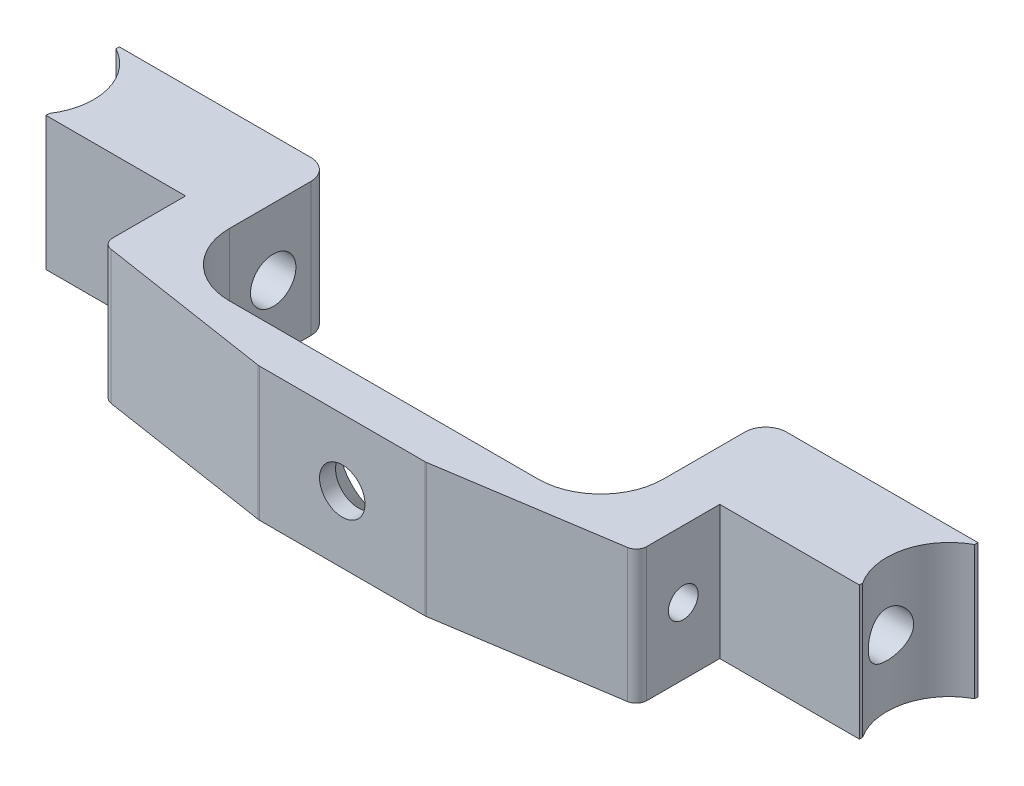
ISO-10303-21;
HEADER;
FILE_DESCRIPTION(('STEP AP214'),'2;1');
FILE_NAME('part.step','',(''),(''),'','','');
FILE_SCHEMA(('AUTOMOTIVE_DESIGN { 1 0 10303 214 1 1 1 1 }'));
ENDSEC;
DATA;
#1=APPLICATION_CONTEXT('core data for automotive mechanical design processes');
#2=APPLICATION_PROTOCOL_DEFINITION('international standard','automotive_design',2000,#1);
#3=PRODUCT_CONTEXT('',#1,'mechanical');
#4=PRODUCT('Part','Part','',(#3));
#5=PRODUCT_RELATED_PRODUCT_CATEGORY('part','',(#4));
#6=PRODUCT_DEFINITION_FORMATION('','',#4);
#7=PRODUCT_DEFINITION_CONTEXT('part definition',#1,'design');
#8=PRODUCT_DEFINITION('design','',#6,#7);
#9=PRODUCT_DEFINITION_SHAPE('','',#8);
#10=(LENGTH_UNIT() NAMED_UNIT(*) SI_UNIT(.MILLI.,.METRE.));
#11=(NAMED_UNIT(*) PLANE_ANGLE_UNIT() SI_UNIT($,.RADIAN.));
#12=(NAMED_UNIT(*) SI_UNIT($,.STERADIAN.) SOLID_ANGLE_UNIT());
#13=UNCERTAINTY_MEASURE_WITH_UNIT(LENGTH_MEASURE(1.E-05),#10,'distance_accuracy_value','');
#14=(GEOMETRIC_REPRESENTATION_CONTEXT(3) GLOBAL_UNCERTAINTY_ASSIGNED_CONTEXT((#13)) GLOBAL_UNIT_ASSIGNED_CONTEXT((#10,
#11,#12)) REPRESENTATION_CONTEXT('',''));
#15=CARTESIAN_POINT('',(0.,0.,0.));
#16=DIRECTION('',(0.,0.,1.));
#17=DIRECTION('',(1.,0.,0.));
#18=AXIS2_PLACEMENT_3D('',#15,#16,#17);
#19=CARTESIAN_POINT('',(0.,-2.54,0.));
#20=DIRECTION('',(0.,-1.,0.));
#21=DIRECTION('',(0.,0.,1.));
#22=AXIS2_PLACEMENT_3D('',#19,#20,#21);
#23=PLANE('',#22);
#24=DIRECTION('',(1.,0.,0.));
#25=VECTOR('',#24,1.);
#26=CARTESIAN_POINT('',(-30.9371191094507,-2.54,86.6774999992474));
#27=LINE('',#26,#25);
#28=CARTESIAN_POINT('',(-30.9371191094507,-2.54,86.6774999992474));
#29=VERTEX_POINT('',#28);
#30=CARTESIAN_POINT('',(-20.32,-2.54,86.6774999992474));
#31=VERTEX_POINT('',#30);
#32=EDGE_CURVE('E271',#29,#31,#27,.T.);
#33=ORIENTED_EDGE('',*,*,#32,.F.);
#34=DIRECTION('',(0.,0.,1.));
#35=VECTOR('',#34,1.);
#36=CARTESIAN_POINT('',(-30.9371191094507,-2.54,86.6774999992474));
#37=LINE('',#36,#35);
#38=CARTESIAN_POINT('',(-30.9371191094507,-2.54,86.4234999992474));
#39=VERTEX_POINT('',#38);
#40=EDGE_CURVE('E290',#39,#29,#37,.T.);
#41=ORIENTED_EDGE('',*,*,#40,.F.);
#42=CARTESIAN_POINT('',(-34.92500000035,-2.54,83.8199999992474));
#43=DIRECTION('',(0.,-1.,0.));
#44=DIRECTION('',(0.,0.,-1.));
#45=AXIS2_PLACEMENT_3D('',#42,#43,#44);
#46=CIRCLE('',#45,4.7625);
#47=CARTESIAN_POINT('',(-32.6629378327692,-2.54,79.6289999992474));
#48=VERTEX_POINT('',#47);
#49=EDGE_CURVE('E589',#48,#39,#46,.T.);
#50=ORIENTED_EDGE('',*,*,#49,.F.);
#51=DIRECTION('',(0.,0.,1.));
#52=VECTOR('',#51,1.);
#53=CARTESIAN_POINT('',(-32.6629378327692,-2.54,79.3749999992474));
#54=LINE('',#53,#52);
#55=CARTESIAN_POINT('',(-32.6629378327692,-2.54,79.3749999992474));
#56=VERTEX_POINT('',#55);
#57=EDGE_CURVE('E581',#56,#48,#54,.T.);
#58=ORIENTED_EDGE('',*,*,#57,.F.);
#59=DIRECTION('',(-1.,0.,0.));
#60=VECTOR('',#59,1.);
#61=CARTESIAN_POINT('',(-32.6629378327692,-2.54,79.3749999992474));
#62=LINE('',#61,#60);
#63=CARTESIAN_POINT('',(-18.0975,-2.54,79.3749999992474));
#64=VERTEX_POINT('',#63);
#65=EDGE_CURVE('E586',#64,#56,#62,.T.);
#66=ORIENTED_EDGE('',*,*,#65,.F.);
#67=CARTESIAN_POINT('',(-18.0975,-2.54,80.9624999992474));
#68=DIRECTION('',(0.,-1.,0.));
#69=DIRECTION('',(0.,0.,-1.));
#70=AXIS2_PLACEMENT_3D('',#67,#68,#69);
#71=CIRCLE('',#70,1.5875);
#72=CARTESIAN_POINT('',(-16.51,-2.54,80.9624999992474));
#73=VERTEX_POINT('',#72);
#74=EDGE_CURVE('E66',#64,#73,#71,.T.);
#75=ORIENTED_EDGE('',*,*,#74,.T.);
#76=DIRECTION('',(0.,0.,1.));
#77=VECTOR('',#76,1.);
#78=CARTESIAN_POINT('',(-16.51,-2.54,83.3133551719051));
#79=LINE('',#78,#77);
#80=CARTESIAN_POINT('',(-16.51,-2.54,87.1593884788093));
#81=VERTEX_POINT('',#80);
#82=EDGE_CURVE('E476',#73,#81,#79,.T.);
#83=ORIENTED_EDGE('',*,*,#82,.T.);
#84=CARTESIAN_POINT('',(-11.7475,-2.54,87.1593884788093));
#85=DIRECTION('',(0.,1.,0.));
#86=DIRECTION('',(0.,0.,1.));
#87=AXIS2_PLACEMENT_3D('',#84,#85,#86);
#88=CIRCLE('',#87,4.7625);
#89=CARTESIAN_POINT('',(-11.7475,-2.54,91.9218884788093));
#90=VERTEX_POINT('',#89);
#91=EDGE_CURVE('E472',#81,#90,#88,.T.);
#92=ORIENTED_EDGE('',*,*,#91,.T.);
#93=DIRECTION('',(1.,0.,0.));
#94=VECTOR('',#93,1.);
#95=CARTESIAN_POINT('',(-11.7475,-2.54,91.9218884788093));
#96=LINE('',#95,#94);
#97=CARTESIAN_POINT('',(11.7475,-2.54,91.9218884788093));
#98=VERTEX_POINT('',#97);
#99=EDGE_CURVE('E468',#90,#98,#96,.T.);
#100=ORIENTED_EDGE('',*,*,#99,.T.);
#101=CARTESIAN_POINT('',(11.7475,-2.54,87.1593884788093));
#102=DIRECTION('',(0.,1.,0.));
#103=DIRECTION('',(0.,0.,1.));
#104=AXIS2_PLACEMENT_3D('',#101,#102,#103);
#105=CIRCLE('',#104,4.7625);
#106=CARTESIAN_POINT('',(16.51,-2.54,87.1593884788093));
#107=VERTEX_POINT('',#106);
#108=EDGE_CURVE('E464',#98,#107,#105,.T.);
#109=ORIENTED_EDGE('',*,*,#108,.T.);
#110=DIRECTION('',(0.,0.,-1.));
#111=VECTOR('',#110,1.);
#112=CARTESIAN_POINT('',(16.51,-2.54,87.1593884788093));
#113=LINE('',#112,#111);
#114=CARTESIAN_POINT('',(16.51,-2.54,80.9624999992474));
#115=VERTEX_POINT('',#114);
#116=EDGE_CURVE('E461',#107,#115,#113,.T.);
#117=ORIENTED_EDGE('',*,*,#116,.T.);
#118=CARTESIAN_POINT('',(18.0975,-2.54,80.9624999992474));
#119=DIRECTION('',(0.,-1.,0.));
#120=DIRECTION('',(0.,0.,-1.));
#121=AXIS2_PLACEMENT_3D('',#118,#119,#120);
#122=CIRCLE('',#121,1.5875);
#123=CARTESIAN_POINT('',(18.0975,-2.54,79.3749999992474));
#124=VERTEX_POINT('',#123);
#125=EDGE_CURVE('E411',#115,#124,#122,.T.);
#126=ORIENTED_EDGE('',*,*,#125,.T.);
#127=DIRECTION('',(-1.,0.,0.));
#128=VECTOR('',#127,1.);
#129=CARTESIAN_POINT('',(20.32,-2.54,79.3749999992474));
#130=LINE('',#129,#128);
#131=CARTESIAN_POINT('',(32.6629378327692,-2.54,79.3749999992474));
#132=VERTEX_POINT('',#131);
#133=EDGE_CURVE('E601',#132,#124,#130,.T.);
#134=ORIENTED_EDGE('',*,*,#133,.F.);
#135=DIRECTION('',(0.,0.,-1.));
#136=VECTOR('',#135,1.);
#137=CARTESIAN_POINT('',(32.6629378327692,-2.54,79.3749999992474));
#138=LINE('',#137,#136);
#139=CARTESIAN_POINT('',(32.6629378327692,-2.54,79.6289999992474));
#140=VERTEX_POINT('',#139);
#141=EDGE_CURVE('E611',#140,#132,#138,.T.);
#142=ORIENTED_EDGE('',*,*,#141,.F.);
#143=CARTESIAN_POINT('',(34.92500000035,-2.54,83.8199999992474));
#144=DIRECTION('',(0.,-1.,0.));
#145=DIRECTION('',(0.,0.,-1.));
#146=AXIS2_PLACEMENT_3D('',#143,#144,#145);
#147=CIRCLE('',#146,4.76249999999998);
#148=CARTESIAN_POINT('',(30.9371191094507,-2.54,86.4234999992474));
#149=VERTEX_POINT('',#148);
#150=EDGE_CURVE('E612',#149,#140,#147,.T.);
#151=ORIENTED_EDGE('',*,*,#150,.F.);
#152=DIRECTION('',(0.,0.,1.));
#153=VECTOR('',#152,1.);
#154=CARTESIAN_POINT('',(30.9371191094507,-2.54,86.6774999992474));
#155=LINE('',#154,#153);
#156=CARTESIAN_POINT('',(30.9371191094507,-2.54,86.6774999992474));
#157=VERTEX_POINT('',#156);
#158=EDGE_CURVE('E305',#149,#157,#155,.T.);
#159=ORIENTED_EDGE('',*,*,#158,.T.);
#160=DIRECTION('',(-1.,0.,0.));
#161=VECTOR('',#160,1.);
#162=CARTESIAN_POINT('',(30.9371191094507,-2.54,86.6774999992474));
#163=LINE('',#162,#161);
#164=CARTESIAN_POINT('',(20.32,-2.54,86.6774999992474));
#165=VERTEX_POINT('',#164);
#166=EDGE_CURVE('E309',#157,#165,#163,.T.);
#167=ORIENTED_EDGE('',*,*,#166,.T.);
#168=DIRECTION('',(0.,0.,1.));
#169=VECTOR('',#168,1.);
#170=CARTESIAN_POINT('',(20.32,-2.54,64.3202028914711));
#171=LINE('',#170,#169);
#172=CARTESIAN_POINT('',(20.32,-2.54,92.2358723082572));
#173=VERTEX_POINT('',#172);
#174=EDGE_CURVE('E575',#165,#173,#171,.T.);
#175=ORIENTED_EDGE('',*,*,#174,.T.);
#176=CARTESIAN_POINT('',(19.52625,-2.54,92.2358723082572));
#177=DIRECTION('',(0.,-1.,0.));
#178=DIRECTION('',(0.,0.,1.));
#179=AXIS2_PLACEMENT_3D('',#176,#177,#178);
#180=CIRCLE('',#179,0.793749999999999);
#181=CARTESIAN_POINT('',(19.6474812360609,-2.54,93.0203097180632));
#182=VERTEX_POINT('',#181);
#183=EDGE_CURVE('E571',#173,#182,#180,.T.);
#184=ORIENTED_EDGE('',*,*,#183,.T.);
#185=DIRECTION('',(-0.988267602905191,0.,0.152732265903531));
#186=VECTOR('',#185,1.);
#187=CARTESIAN_POINT('',(19.6474812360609,-2.54,93.0203097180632));
#188=LINE('',#187,#186);
#189=CARTESIAN_POINT('',(6.41025793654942,-2.54,95.0660624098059));
#190=VERTEX_POINT('',#189);
#191=EDGE_CURVE('E567',#182,#190,#188,.T.);
#192=ORIENTED_EDGE('',*,*,#191,.T.);
#193=CARTESIAN_POINT('',(6.2890267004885,-2.54,94.2816249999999));
#194=DIRECTION('',(0.,-1.,0.));
#195=DIRECTION('',(0.,0.,1.));
#196=AXIS2_PLACEMENT_3D('',#193,#194,#195);
#197=CIRCLE('',#196,0.793749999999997);
#198=CARTESIAN_POINT('',(6.2890267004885,-2.54,95.0753749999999));
#199=VERTEX_POINT('',#198);
#200=EDGE_CURVE('E563',#190,#199,#197,.T.);
#201=ORIENTED_EDGE('',*,*,#200,.T.);
#202=DIRECTION('',(-1.,0.,0.));
#203=VECTOR('',#202,1.);
#204=CARTESIAN_POINT('',(6.2890267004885,-2.54,95.0753749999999));
#205=LINE('',#204,#203);
#206=CARTESIAN_POINT('',(-6.28902670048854,-2.54,95.0753749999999));
#207=VERTEX_POINT('',#206);
#208=EDGE_CURVE('E559',#199,#207,#205,.T.);
#209=ORIENTED_EDGE('',*,*,#208,.T.);
#210=CARTESIAN_POINT('',(-6.28902670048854,-2.54,94.2816249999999));
#211=DIRECTION('',(0.,-1.,0.));
#212=DIRECTION('',(0.,0.,1.));
#213=AXIS2_PLACEMENT_3D('',#210,#211,#212);
#214=CIRCLE('',#213,0.793749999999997);
#215=CARTESIAN_POINT('',(-6.41025793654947,-2.54,95.0660624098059));
#216=VERTEX_POINT('',#215);
#217=EDGE_CURVE('E555',#207,#216,#214,.T.);
#218=ORIENTED_EDGE('',*,*,#217,.T.);
#219=DIRECTION('',(-0.988267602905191,0.,-0.152732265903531));
#220=VECTOR('',#219,1.);
#221=CARTESIAN_POINT('',(-6.41025793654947,-2.54,95.0660624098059));
#222=LINE('',#221,#220);
#223=CARTESIAN_POINT('',(-19.6474812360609,-2.54,93.0203097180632));
#224=VERTEX_POINT('',#223);
#225=EDGE_CURVE('E552',#216,#224,#222,.T.);
#226=ORIENTED_EDGE('',*,*,#225,.T.);
#227=CARTESIAN_POINT('',(-19.52625,-2.54,92.2358723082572));
#228=DIRECTION('',(0.,-1.,0.));
#229=DIRECTION('',(0.,0.,1.));
#230=AXIS2_PLACEMENT_3D('',#227,#228,#229);
#231=CIRCLE('',#230,0.793749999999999);
#232=CARTESIAN_POINT('',(-20.32,-2.54,92.2358723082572));
#233=VERTEX_POINT('',#232);
#234=EDGE_CURVE('E274',#224,#233,#231,.T.);
#235=ORIENTED_EDGE('',*,*,#234,.T.);
#236=DIRECTION('',(0.,0.,-1.));
#237=VECTOR('',#236,1.);
#238=CARTESIAN_POINT('',(-20.32,-2.54,92.2358723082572));
#239=LINE('',#238,#237);
#240=EDGE_CURVE('E268',#233,#31,#239,.T.);
#241=ORIENTED_EDGE('',*,*,#240,.T.);
#242=EDGE_LOOP('',(#33,#41,#50,#58,#66,#75,#83,#92,#100,#109,#117,#126,#134,#142,#151,#159,#167,
#175,#184,#192,#201,#209,#218,#226,#235,#241));
#243=FACE_BOUND('',#242,.T.);
#244=ADVANCED_FACE('F41',(#243),#23,.T.);
#245=CARTESIAN_POINT('',(0.,7.62,0.));
#246=DIRECTION('',(0.,1.,0.));
#247=DIRECTION('',(0.,0.,-1.));
#248=AXIS2_PLACEMENT_3D('',#245,#246,#247);
#249=PLANE('',#248);
#250=CARTESIAN_POINT('',(-34.92500000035,7.62,83.8199999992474));
#251=DIRECTION('',(0.,1.,0.));
#252=DIRECTION('',(0.,0.,1.));
#253=AXIS2_PLACEMENT_3D('',#250,#251,#252);
#254=CIRCLE('',#253,4.7625);
#255=CARTESIAN_POINT('',(-32.6629378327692,7.62,79.6289999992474));
#256=VERTEX_POINT('',#255);
#257=CARTESIAN_POINT('',(-30.9371191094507,7.62,86.4234999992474));
#258=VERTEX_POINT('',#257);
#259=EDGE_CURVE('E596',#256,#258,#254,.F.);
#260=ORIENTED_EDGE('',*,*,#259,.T.);
#261=DIRECTION('',(0.,0.,1.));
#262=VECTOR('',#261,1.);
#263=CARTESIAN_POINT('',(-30.9371191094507,7.62,86.6774999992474));
#264=LINE('',#263,#262);
#265=CARTESIAN_POINT('',(-30.9371191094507,7.62,86.6774999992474));
#266=VERTEX_POINT('',#265);
#267=EDGE_CURVE('E291',#258,#266,#264,.T.);
#268=ORIENTED_EDGE('',*,*,#267,.T.);
#269=DIRECTION('',(1.,0.,0.));
#270=VECTOR('',#269,1.);
#271=CARTESIAN_POINT('',(-30.9371191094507,7.62,86.6774999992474));
#272=LINE('',#271,#270);
#273=CARTESIAN_POINT('',(-20.32,7.62,86.6774999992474));
#274=VERTEX_POINT('',#273);
#275=EDGE_CURVE('E1064',#266,#274,#272,.T.);
#276=ORIENTED_EDGE('',*,*,#275,.T.);
#277=DIRECTION('',(0.,0.,-1.));
#278=VECTOR('',#277,1.);
#279=CARTESIAN_POINT('',(-20.32,7.62,62.1684134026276));
#280=LINE('',#279,#278);
#281=CARTESIAN_POINT('',(-20.32,7.62,92.2358723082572));
#282=VERTEX_POINT('',#281);
#283=EDGE_CURVE('E294',#282,#274,#280,.T.);
#284=ORIENTED_EDGE('',*,*,#283,.F.);
#285=CARTESIAN_POINT('',(-19.52625,7.62,92.2358723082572));
#286=DIRECTION('',(0.,-1.,0.));
#287=DIRECTION('',(0.,0.,-1.));
#288=AXIS2_PLACEMENT_3D('',#285,#286,#287);
#289=CIRCLE('',#288,0.793749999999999);
#290=CARTESIAN_POINT('',(-19.6474812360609,7.62,93.0203097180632));
#291=VERTEX_POINT('',#290);
#292=EDGE_CURVE('E506',#291,#282,#289,.T.);
#293=ORIENTED_EDGE('',*,*,#292,.F.);
#294=DIRECTION('',(-0.988267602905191,0.,-0.152732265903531));
#295=VECTOR('',#294,1.);
#296=CARTESIAN_POINT('',(-19.6474812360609,7.62,93.0203097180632));
#297=LINE('',#296,#295);
#298=CARTESIAN_POINT('',(-6.41025793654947,7.62,95.0660624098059));
#299=VERTEX_POINT('',#298);
#300=EDGE_CURVE('E510',#299,#291,#297,.T.);
#301=ORIENTED_EDGE('',*,*,#300,.F.);
#302=CARTESIAN_POINT('',(-6.28902670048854,7.62,94.2816249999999));
#303=DIRECTION('',(0.,-1.,0.));
#304=DIRECTION('',(0.,0.,-1.));
#305=AXIS2_PLACEMENT_3D('',#302,#303,#304);
#306=CIRCLE('',#305,0.793749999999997);
#307=CARTESIAN_POINT('',(-6.28902670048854,7.62,95.0753749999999));
#308=VERTEX_POINT('',#307);
#309=EDGE_CURVE('E514',#308,#299,#306,.T.);
#310=ORIENTED_EDGE('',*,*,#309,.F.);
#311=DIRECTION('',(-1.,0.,0.));
#312=VECTOR('',#311,1.);
#313=CARTESIAN_POINT('',(-6.28902670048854,7.62,95.0753749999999));
#314=LINE('',#313,#312);
#315=CARTESIAN_POINT('',(6.2890267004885,7.62,95.0753749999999));
#316=VERTEX_POINT('',#315);
#317=EDGE_CURVE('E518',#316,#308,#314,.T.);
#318=ORIENTED_EDGE('',*,*,#317,.F.);
#319=CARTESIAN_POINT('',(6.2890267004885,7.62,94.2816249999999));
#320=DIRECTION('',(0.,-1.,0.));
#321=DIRECTION('',(0.,0.,-1.));
#322=AXIS2_PLACEMENT_3D('',#319,#320,#321);
#323=CIRCLE('',#322,0.793749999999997);
#324=CARTESIAN_POINT('',(6.41025793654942,7.62,95.0660624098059));
#325=VERTEX_POINT('',#324);
#326=EDGE_CURVE('E522',#325,#316,#323,.T.);
#327=ORIENTED_EDGE('',*,*,#326,.F.);
#328=DIRECTION('',(-0.988267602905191,0.,0.152732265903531));
#329=VECTOR('',#328,1.);
#330=CARTESIAN_POINT('',(6.41025793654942,7.62,95.0660624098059));
#331=LINE('',#330,#329);
#332=CARTESIAN_POINT('',(19.6474812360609,7.62,93.0203097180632));
#333=VERTEX_POINT('',#332);
#334=EDGE_CURVE('E526',#333,#325,#331,.T.);
#335=ORIENTED_EDGE('',*,*,#334,.F.);
#336=CARTESIAN_POINT('',(19.52625,7.62,92.2358723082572));
#337=DIRECTION('',(0.,-1.,0.));
#338=DIRECTION('',(0.,0.,-1.));
#339=AXIS2_PLACEMENT_3D('',#336,#337,#338);
#340=CIRCLE('',#339,0.793749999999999);
#341=CARTESIAN_POINT('',(20.32,7.62,92.2358723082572));
#342=VERTEX_POINT('',#341);
#343=EDGE_CURVE('E530',#342,#333,#340,.T.);
#344=ORIENTED_EDGE('',*,*,#343,.F.);
#345=DIRECTION('',(0.,0.,1.));
#346=VECTOR('',#345,1.);
#347=CARTESIAN_POINT('',(20.32,7.62,62.1684134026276));
#348=LINE('',#347,#346);
#349=CARTESIAN_POINT('',(20.32,7.62,86.6774999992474));
#350=VERTEX_POINT('',#349);
#351=EDGE_CURVE('E534',#350,#342,#348,.T.);
#352=ORIENTED_EDGE('',*,*,#351,.F.);
#353=DIRECTION('',(-1.,0.,0.));
#354=VECTOR('',#353,1.);
#355=CARTESIAN_POINT('',(30.9371191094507,7.62,86.6774999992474));
#356=LINE('',#355,#354);
#357=CARTESIAN_POINT('',(30.9371191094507,7.62,86.6774999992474));
#358=VERTEX_POINT('',#357);
#359=EDGE_CURVE('E310',#358,#350,#356,.T.);
#360=ORIENTED_EDGE('',*,*,#359,.F.);
#361=DIRECTION('',(0.,0.,1.));
#362=VECTOR('',#361,1.);
#363=CARTESIAN_POINT('',(30.9371191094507,7.62,86.6774999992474));
#364=LINE('',#363,#362);
#365=CARTESIAN_POINT('',(30.9371191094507,7.62,86.4234999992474));
#366=VERTEX_POINT('',#365);
#367=EDGE_CURVE('E315',#366,#358,#364,.T.);
#368=ORIENTED_EDGE('',*,*,#367,.F.);
#369=CARTESIAN_POINT('',(34.92500000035,7.62,83.8199999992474));
#370=DIRECTION('',(0.,1.,0.));
#371=DIRECTION('',(0.,0.,1.));
#372=AXIS2_PLACEMENT_3D('',#369,#370,#371);
#373=CIRCLE('',#372,4.76249999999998);
#374=CARTESIAN_POINT('',(32.6629378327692,7.62,79.6289999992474));
#375=VERTEX_POINT('',#374);
#376=EDGE_CURVE('E620',#366,#375,#373,.F.);
#377=ORIENTED_EDGE('',*,*,#376,.T.);
#378=DIRECTION('',(0.,0.,-1.));
#379=VECTOR('',#378,1.);
#380=CARTESIAN_POINT('',(32.6629378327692,7.62,79.3749999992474));
#381=LINE('',#380,#379);
#382=CARTESIAN_POINT('',(32.6629378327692,7.62,79.3749999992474));
#383=VERTEX_POINT('',#382);
#384=EDGE_CURVE('E622',#375,#383,#381,.T.);
#385=ORIENTED_EDGE('',*,*,#384,.T.);
#386=DIRECTION('',(-1.,0.,0.));
#387=VECTOR('',#386,1.);
#388=CARTESIAN_POINT('',(20.32,7.62,79.3749999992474));
#389=LINE('',#388,#387);
#390=CARTESIAN_POINT('',(18.0975,7.62,79.3749999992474));
#391=VERTEX_POINT('',#390);
#392=EDGE_CURVE('E619',#383,#391,#389,.T.);
#393=ORIENTED_EDGE('',*,*,#392,.T.);
#394=CARTESIAN_POINT('',(18.0975,7.62,80.9624999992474));
#395=DIRECTION('',(0.,1.,0.));
#396=DIRECTION('',(0.,0.,1.));
#397=AXIS2_PLACEMENT_3D('',#394,#395,#396);
#398=CIRCLE('',#397,1.5875);
#399=CARTESIAN_POINT('',(16.51,7.62,80.9624999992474));
#400=VERTEX_POINT('',#399);
#401=EDGE_CURVE('E427',#391,#400,#398,.T.);
#402=ORIENTED_EDGE('',*,*,#401,.T.);
#403=DIRECTION('',(0.,0.,-1.));
#404=VECTOR('',#403,1.);
#405=CARTESIAN_POINT('',(16.51,7.62,63.2869174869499));
#406=LINE('',#405,#404);
#407=CARTESIAN_POINT('',(16.51,7.62,87.1593884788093));
#408=VERTEX_POINT('',#407);
#409=EDGE_CURVE('E537',#408,#400,#406,.T.);
#410=ORIENTED_EDGE('',*,*,#409,.F.);
#411=CARTESIAN_POINT('',(11.7475,7.62,87.1593884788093));
#412=DIRECTION('',(0.,1.,0.));
#413=DIRECTION('',(0.,0.,1.));
#414=AXIS2_PLACEMENT_3D('',#411,#412,#413);
#415=CIRCLE('',#414,4.7625);
#416=CARTESIAN_POINT('',(11.7475,7.62,91.9218884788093));
#417=VERTEX_POINT('',#416);
#418=EDGE_CURVE('E541',#417,#408,#415,.T.);
#419=ORIENTED_EDGE('',*,*,#418,.F.);
#420=DIRECTION('',(1.,0.,0.));
#421=VECTOR('',#420,1.);
#422=CARTESIAN_POINT('',(-11.7475,7.62,91.9218884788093));
#423=LINE('',#422,#421);
#424=CARTESIAN_POINT('',(-11.7475,7.62,91.9218884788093));
#425=VERTEX_POINT('',#424);
#426=EDGE_CURVE('E545',#425,#417,#423,.T.);
#427=ORIENTED_EDGE('',*,*,#426,.F.);
#428=CARTESIAN_POINT('',(-11.7475,7.62,87.1593884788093));
#429=DIRECTION('',(0.,1.,0.));
#430=DIRECTION('',(0.,0.,-1.));
#431=AXIS2_PLACEMENT_3D('',#428,#429,#430);
#432=CIRCLE('',#431,4.7625);
#433=CARTESIAN_POINT('',(-16.51,7.62,87.1593884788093));
#434=VERTEX_POINT('',#433);
#435=EDGE_CURVE('E547',#434,#425,#432,.T.);
#436=ORIENTED_EDGE('',*,*,#435,.F.);
#437=DIRECTION('',(0.,0.,1.));
#438=VECTOR('',#437,1.);
#439=CARTESIAN_POINT('',(-16.51,7.62,63.2869174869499));
#440=LINE('',#439,#438);
#441=CARTESIAN_POINT('',(-16.51,7.62,80.9624999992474));
#442=VERTEX_POINT('',#441);
#443=EDGE_CURVE('E279',#442,#434,#440,.T.);
#444=ORIENTED_EDGE('',*,*,#443,.F.);
#445=CARTESIAN_POINT('',(-18.0975,7.62,80.9624999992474));
#446=DIRECTION('',(0.,1.,0.));
#447=DIRECTION('',(0.,0.,1.));
#448=AXIS2_PLACEMENT_3D('',#445,#446,#447);
#449=CIRCLE('',#448,1.5875);
#450=CARTESIAN_POINT('',(-18.0975,7.62,79.3749999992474));
#451=VERTEX_POINT('',#450);
#452=EDGE_CURVE('E429',#442,#451,#449,.T.);
#453=ORIENTED_EDGE('',*,*,#452,.T.);
#454=DIRECTION('',(-1.,0.,0.));
#455=VECTOR('',#454,1.);
#456=CARTESIAN_POINT('',(-32.6629378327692,7.62,79.3749999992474));
#457=LINE('',#456,#455);
#458=CARTESIAN_POINT('',(-32.6629378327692,7.62,79.3749999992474));
#459=VERTEX_POINT('',#458);
#460=EDGE_CURVE('E597',#451,#459,#457,.T.);
#461=ORIENTED_EDGE('',*,*,#460,.T.);
#462=DIRECTION('',(0.,0.,1.));
#463=VECTOR('',#462,1.);
#464=CARTESIAN_POINT('',(-32.6629378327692,7.62,79.3749999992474));
#465=LINE('',#464,#463);
#466=EDGE_CURVE('E600',#459,#256,#465,.T.);
#467=ORIENTED_EDGE('',*,*,#466,.T.);
#468=EDGE_LOOP('',(#260,#268,#276,#284,#293,#301,#310,#318,#327,#335,#344,#352,#360,#368,#377,
#385,#393,#402,#410,#419,#427,#436,#444,#453,#461,#467));
#469=FACE_BOUND('',#468,.T.);
#470=ADVANCED_FACE('F390',(#469),#249,.T.);
#471=CARTESIAN_POINT('',(-34.92500000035,-17.7511871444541,83.8199999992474));
#472=DIRECTION('',(0.,1.,0.));
#473=DIRECTION('',(0.,0.,1.));
#474=AXIS2_PLACEMENT_3D('',#471,#472,#473);
#475=CYLINDRICAL_SURFACE('',#474,4.7625);
#476=CARTESIAN_POINT('',(-30.4867361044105,2.54,85.5471999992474));
#477=CARTESIAN_POINT('',(-30.4867382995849,2.63352501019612,85.5472024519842));
#478=CARTESIAN_POINT('',(-30.4837477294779,2.72703326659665,85.5395782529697));
#479=CARTESIAN_POINT('',(-30.4721856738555,2.91124533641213,85.5094105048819));
#480=CARTESIAN_POINT('',(-30.4636140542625,3.00194908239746,85.4868665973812));
#481=CARTESIAN_POINT('',(-30.4419858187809,3.17784542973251,85.427783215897));
#482=CARTESIAN_POINT('',(-30.4289393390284,3.26304997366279,85.3912753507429));
#483=CARTESIAN_POINT('',(-30.3998472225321,3.42615674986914,85.3054112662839));
#484=CARTESIAN_POINT('',(-30.3838007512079,3.50405694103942,85.2560514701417));
#485=CARTESIAN_POINT('',(-30.3496816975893,3.65396046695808,85.1434299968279));
#486=CARTESIAN_POINT('',(-30.3315521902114,3.72557623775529,85.0796695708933));
#487=CARTESIAN_POINT('',(-30.2957865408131,3.85736907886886,84.9411168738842));
#488=CARTESIAN_POINT('',(-30.2781504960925,3.91754390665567,84.8663224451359));
#489=CARTESIAN_POINT('',(-30.2446876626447,4.02657993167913,84.7049162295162));
#490=CARTESIAN_POINT('',(-30.2289354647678,4.0750245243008,84.6180061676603));
#491=CARTESIAN_POINT('',(-30.201695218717,4.15644698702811,84.4365986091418));
#492=CARTESIAN_POINT('',(-30.1902057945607,4.18942984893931,84.3421035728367));
#493=CARTESIAN_POINT('',(-30.173189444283,4.2376472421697,84.1522797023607));
#494=CARTESIAN_POINT('',(-30.167439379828,4.25354798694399,84.0571404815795));
#495=CARTESIAN_POINT('',(-30.1617515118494,4.2692794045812,83.8653819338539));
#496=CARTESIAN_POINT('',(-30.1618119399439,4.26911496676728,83.76876306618));
#497=CARTESIAN_POINT('',(-30.1675934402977,4.25311933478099,83.5815446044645));
#498=CARTESIAN_POINT('',(-30.1730521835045,4.23801417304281,83.4908734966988));
#499=CARTESIAN_POINT('',(-30.1886774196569,4.19378079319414,83.3134532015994));
#500=CARTESIAN_POINT('',(-30.1988442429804,4.16465159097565,83.2267042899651));
#501=CARTESIAN_POINT('',(-30.2230509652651,4.09283396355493,83.0581327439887));
#502=CARTESIAN_POINT('',(-30.237143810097,4.04995887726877,82.9763975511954));
#503=CARTESIAN_POINT('',(-30.2677637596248,3.95202792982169,82.821084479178));
#504=CARTESIAN_POINT('',(-30.2842916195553,3.8969682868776,82.7475091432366));
#505=CARTESIAN_POINT('',(-30.3191399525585,3.77268260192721,82.6063121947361));
#506=CARTESIAN_POINT('',(-30.3375090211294,3.70284351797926,82.539241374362));
#507=CARTESIAN_POINT('',(-30.3732297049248,3.55278305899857,82.4175649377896));
#508=CARTESIAN_POINT('',(-30.390581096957,3.47255941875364,82.3629620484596));
#509=CARTESIAN_POINT('',(-30.422596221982,3.30196723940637,82.2668116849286));
#510=CARTESIAN_POINT('',(-30.437200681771,3.21143082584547,82.2255407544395));
#511=CARTESIAN_POINT('',(-30.4613846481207,3.02402535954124,82.1590329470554));
#512=CARTESIAN_POINT('',(-30.4709667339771,2.92715958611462,82.1337878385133));
#513=CARTESIAN_POINT('',(-30.4834203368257,2.73525794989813,82.1012604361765));
#514=CARTESIAN_POINT('',(-30.4866160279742,2.640390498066,82.0931092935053));
#515=CARTESIAN_POINT('',(-30.4868493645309,2.45061012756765,82.0925082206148));
#516=CARTESIAN_POINT('',(-30.4838884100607,2.3556972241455,82.1000547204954));
#517=CARTESIAN_POINT('',(-30.4724695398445,2.17281579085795,82.1298488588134));
#518=CARTESIAN_POINT('',(-30.4642549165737,2.08472445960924,82.1514465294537));
#519=CARTESIAN_POINT('',(-30.4435364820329,1.91344882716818,82.2079239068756));
#520=CARTESIAN_POINT('',(-30.4310318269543,1.8302654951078,82.2428062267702));
#521=CARTESIAN_POINT('',(-30.4025897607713,1.66785503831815,82.3262741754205));
#522=CARTESIAN_POINT('',(-30.3865453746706,1.58887658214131,82.3753061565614));
#523=CARTESIAN_POINT('',(-30.3530196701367,1.43995802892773,82.4851975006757));
#524=CARTESIAN_POINT('',(-30.3355378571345,1.37002106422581,82.5460609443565));
#525=CARTESIAN_POINT('',(-30.2998688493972,1.23692456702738,82.6821118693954));
#526=CARTESIAN_POINT('',(-30.2817003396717,1.17440222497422,82.7579296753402));
#527=CARTESIAN_POINT('',(-30.2476954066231,1.06290221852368,82.9194289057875));
#528=CARTESIAN_POINT('',(-30.2318589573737,1.01392440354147,83.0051102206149));
#529=CARTESIAN_POINT('',(-30.2043365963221,0.931275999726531,83.1837140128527));
#530=CARTESIAN_POINT('',(-30.1926316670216,0.897535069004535,83.2766008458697));
#531=CARTESIAN_POINT('',(-30.1746187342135,0.846330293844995,83.4672490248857));
#532=CARTESIAN_POINT('',(-30.168308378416,0.82885935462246,83.565008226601));
#533=CARTESIAN_POINT('',(-30.1620047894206,0.811417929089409,83.7568470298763));
#534=CARTESIAN_POINT('',(-30.1616838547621,0.81053957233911,83.8508341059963));
#535=CARTESIAN_POINT('',(-30.1665554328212,0.82400233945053,84.0375565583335));
#536=CARTESIAN_POINT('',(-30.1717473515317,0.838341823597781,84.1302920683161));
#537=CARTESIAN_POINT('',(-30.1869199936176,0.881204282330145,84.3098534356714));
#538=CARTESIAN_POINT('',(-30.1967947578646,0.909413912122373,84.3967637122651));
#539=CARTESIAN_POINT('',(-30.2203088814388,0.978911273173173,84.5646337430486));
#540=CARTESIAN_POINT('',(-30.2339489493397,1.02020146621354,84.6455923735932));
#541=CARTESIAN_POINT('',(-30.2643068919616,1.11660703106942,84.8028646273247));
#542=CARTESIAN_POINT('',(-30.2811274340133,1.17221666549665,84.8788551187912));
#543=CARTESIAN_POINT('',(-30.3157659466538,1.29488523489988,85.0207118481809));
#544=CARTESIAN_POINT('',(-30.3335842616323,1.36194813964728,85.0865745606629));
#545=CARTESIAN_POINT('',(-30.3692604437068,1.50949691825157,85.2095852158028));
#546=CARTESIAN_POINT('',(-30.3870782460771,1.59047634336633,85.2661549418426));
#547=CARTESIAN_POINT('',(-30.4197306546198,1.76135710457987,85.3648849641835));
#548=CARTESIAN_POINT('',(-30.4345653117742,1.85125828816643,85.4070455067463));
#549=CARTESIAN_POINT('',(-30.4595432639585,2.03910011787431,85.4760447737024));
#550=CARTESIAN_POINT('',(-30.4696068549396,2.13714722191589,85.5026248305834));
#551=CARTESIAN_POINT('',(-30.4832002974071,2.33680412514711,85.5381963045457));
#552=CARTESIAN_POINT('',(-30.4867337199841,2.43841194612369,85.5471973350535));
#553=CARTESIAN_POINT('',(-30.4867361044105,2.54,85.5471999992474));
#554=B_SPLINE_CURVE_WITH_KNOTS('',3,(#476,#477,#478,#479,#480,#481,#482,#483,#484,#485,#486,
#487,#488,#489,#490,#491,#492,#493,#494,#495,#496,#497,#498,#499,#500,#501,#502,#503,#504,#505,
#506,#507,#508,#509,#510,#511,#512,#513,#514,#515,#516,#517,#518,#519,#520,#521,#522,#523,#524,
#525,#526,#527,#528,#529,#530,#531,#532,#533,#534,#535,#536,#537,#538,#539,#540,#541,#542,#543,
#544,#545,#546,#547,#548,#549,#550,#551,#552,#553),.UNSPECIFIED.,.T.,.F.,(4,2,2,2,2,2,2,2,2,2,2,
2,2,2,2,2,2,2,2,2,2,2,2,2,2,2,2,2,2,2,2,2,2,2,2,2,2,2,4),(0.,0.280197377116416,
0.560401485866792,0.839975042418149,1.11962649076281,1.41107897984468,1.7025885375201,
2.00329061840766,2.30389555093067,2.59229594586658,2.88060856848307,3.15556663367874,
3.43054399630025,3.70942590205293,3.98839448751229,4.28272167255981,4.57711316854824,
4.87726856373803,5.17726965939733,5.46161111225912,5.74588790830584,6.01786922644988,
6.28990407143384,6.57168943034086,6.85357215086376,7.15197079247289,7.45036611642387,
7.74736943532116,8.04424318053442,8.32482325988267,8.60537310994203,8.8798575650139,
9.15439370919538,9.44010280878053,9.72591113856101,10.0255929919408,10.3252697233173,
10.6297902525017,10.9341442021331),.UNSPECIFIED.);
#555=CARTESIAN_POINT('',(-30.4867361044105,2.54,85.5471999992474));
#556=VERTEX_POINT('',#555);
#557=EDGE_CURVE('E332',#556,#556,#554,.T.);
#558=ORIENTED_EDGE('',*,*,#557,.F.);
#559=EDGE_LOOP('',(#558));
#560=FACE_BOUND('',#559,.T.);
#561=ORIENTED_EDGE('',*,*,#49,.T.);
#562=DIRECTION('',(0.,1.,0.));
#563=VECTOR('',#562,1.);
#564=CARTESIAN_POINT('',(-30.9371191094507,-2.54,86.4234999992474));
#565=LINE('',#564,#563);
#566=EDGE_CURVE('E299',#39,#258,#565,.T.);
#567=ORIENTED_EDGE('',*,*,#566,.T.);
#568=ORIENTED_EDGE('',*,*,#259,.F.);
#569=DIRECTION('',(0.,1.,0.));
#570=VECTOR('',#569,1.);
#571=CARTESIAN_POINT('',(-32.6629378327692,-17.7511871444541,79.6289999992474));
#572=LINE('',#571,#570);
#573=EDGE_CURVE('E578',#48,#256,#572,.T.);
#574=ORIENTED_EDGE('',*,*,#573,.F.);
#575=EDGE_LOOP('',(#561,#567,#568,#574));
#576=FACE_BOUND('',#575,.T.);
#577=ADVANCED_FACE('F343',(#560,#576),#475,.F.);
#578=CARTESIAN_POINT('',(-20.32,7.62,62.1684134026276));
#579=DIRECTION('',(1.,0.,0.));
#580=DIRECTION('',(0.,0.,-1.));
#581=AXIS2_PLACEMENT_3D('',#578,#579,#580);
#582=PLANE('',#581);
#583=CARTESIAN_POINT('',(-20.32,2.54,89.4566861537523));
#584=DIRECTION('',(1.,0.,0.));
#585=DIRECTION('',(0.,0.,-1.));
#586=AXIS2_PLACEMENT_3D('',#583,#584,#585);
#587=CIRCLE('',#586,1.13029999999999);
#588=CARTESIAN_POINT('',(-20.32,2.54,88.3263861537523));
#589=VERTEX_POINT('',#588);
#590=EDGE_CURVE('E702',#589,#589,#587,.T.);
#591=ORIENTED_EDGE('',*,*,#590,.T.);
#592=EDGE_LOOP('',(#591));
#593=FACE_BOUND('',#592,.T.);
#594=DIRECTION('',(0.,1.,0.));
#595=VECTOR('',#594,1.);
#596=CARTESIAN_POINT('',(-20.32,-2.54,86.6774999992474));
#597=LINE('',#596,#595);
#598=EDGE_CURVE('E286',#31,#274,#597,.T.);
#599=ORIENTED_EDGE('',*,*,#598,.F.);
#600=ORIENTED_EDGE('',*,*,#240,.F.);
#601=DIRECTION('',(0.,-1.,0.));
#602=VECTOR('',#601,1.);
#603=CARTESIAN_POINT('',(-20.32,7.62,92.2358723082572));
#604=LINE('',#603,#602);
#605=EDGE_CURVE('E501',#282,#233,#604,.T.);
#606=ORIENTED_EDGE('',*,*,#605,.F.);
#607=ORIENTED_EDGE('',*,*,#283,.T.);
#608=EDGE_LOOP('',(#599,#600,#606,#607));
#609=FACE_BOUND('',#608,.T.);
#610=ADVANCED_FACE('F293',(#593,#609),#582,.F.);
#611=CARTESIAN_POINT('',(-16.51,-2.54,83.3133551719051));
#612=DIRECTION('',(1.,0.,0.));
#613=DIRECTION('',(0.,0.,-1.));
#614=AXIS2_PLACEMENT_3D('',#611,#612,#613);
#615=PLANE('',#614);
#616=CARTESIAN_POINT('',(-16.51,2.54,83.8199999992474));
#617=DIRECTION('',(1.,0.,0.));
#618=DIRECTION('',(0.,0.,-1.));
#619=AXIS2_PLACEMENT_3D('',#616,#617,#618);
#620=CIRCLE('',#619,1.72719999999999);
#621=CARTESIAN_POINT('',(-16.51,2.54,82.0927999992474));
#622=VERTEX_POINT('',#621);
#623=EDGE_CURVE('E623',#622,#622,#620,.T.);
#624=ORIENTED_EDGE('',*,*,#623,.F.);
#625=EDGE_LOOP('',(#624));
#626=FACE_BOUND('',#625,.T.);
#627=ORIENTED_EDGE('',*,*,#82,.F.);
#628=DIRECTION('',(0.,1.,0.));
#629=VECTOR('',#628,1.);
#630=CARTESIAN_POINT('',(-16.51,-2.54,80.9624999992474));
#631=LINE('',#630,#629);
#632=EDGE_CURVE('E56',#73,#442,#631,.T.);
#633=ORIENTED_EDGE('',*,*,#632,.T.);
#634=ORIENTED_EDGE('',*,*,#443,.T.);
#635=DIRECTION('',(0.,1.,0.));
#636=VECTOR('',#635,1.);
#637=CARTESIAN_POINT('',(-16.51,-2.54,87.1593884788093));
#638=LINE('',#637,#636);
#639=EDGE_CURVE('E367',#81,#434,#638,.T.);
#640=ORIENTED_EDGE('',*,*,#639,.F.);
#641=EDGE_LOOP('',(#627,#633,#634,#640));
#642=FACE_BOUND('',#641,.T.);
#643=ADVANCED_FACE('F397',(#626,#642),#615,.T.);
#644=CARTESIAN_POINT('',(-11.7475,-2.54,87.1593884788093));
#645=DIRECTION('',(0.,1.,0.));
#646=DIRECTION('',(0.,0.,-1.));
#647=AXIS2_PLACEMENT_3D('',#644,#645,#646);
#648=CYLINDRICAL_SURFACE('',#647,4.7625);
#649=CARTESIAN_POINT('',(-16.3648068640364,2.54,88.3263861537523));
#650=CARTESIAN_POINT('',(-16.3648069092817,2.60169518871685,88.3263861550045));
#651=CARTESIAN_POINT('',(-16.3635354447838,2.66339124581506,88.3314517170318));
#652=CARTESIAN_POINT('',(-16.3583867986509,2.78502858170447,88.3515441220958));
#653=CARTESIAN_POINT('',(-16.3545095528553,2.8449698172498,88.3665712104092));
#654=CARTESIAN_POINT('',(-16.343976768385,2.96138795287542,88.4060730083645));
#655=CARTESIAN_POINT('',(-16.3373215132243,3.01786520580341,88.430546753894));
#656=CARTESIAN_POINT('',(-16.3209950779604,3.12577451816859,88.4880867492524));
#657=CARTESIAN_POINT('',(-16.3113240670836,3.17720686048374,88.5211525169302));
#658=CARTESIAN_POINT('',(-16.2886966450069,3.27378360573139,88.5948056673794));
#659=CARTESIAN_POINT('',(-16.2757309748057,3.31890972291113,88.6354141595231));
#660=CARTESIAN_POINT('',(-16.2463659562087,3.40159847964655,88.7226301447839));
#661=CARTESIAN_POINT('',(-16.2299665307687,3.43916094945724,88.7692377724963));
#662=CARTESIAN_POINT('',(-16.1933123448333,3.5067216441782,88.8678915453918));
#663=CARTESIAN_POINT('',(-16.1729815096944,3.53653763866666,88.9200339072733));
#664=CARTESIAN_POINT('',(-16.1288585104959,3.58717325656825,89.0271302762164));
#665=CARTESIAN_POINT('',(-16.1050655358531,3.60799076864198,89.082084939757));
#666=CARTESIAN_POINT('',(-16.0527437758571,3.64170462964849,89.1966634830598));
#667=CARTESIAN_POINT('',(-16.0240114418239,3.65402157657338,89.2563638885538));
#668=CARTESIAN_POINT('',(-15.963542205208,3.66897390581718,89.3754349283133));
#669=CARTESIAN_POINT('',(-15.9318041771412,3.67160564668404,89.4348054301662));
#670=CARTESIAN_POINT('',(-15.8622250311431,3.6675883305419,89.5585620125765));
#671=CARTESIAN_POINT('',(-15.824100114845,3.65985159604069,89.6227521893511));
#672=CARTESIAN_POINT('',(-15.7458852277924,3.63404015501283,89.7477805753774));
#673=CARTESIAN_POINT('',(-15.7057938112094,3.61595773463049,89.8086162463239));
#674=CARTESIAN_POINT('',(-15.619237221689,3.56713518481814,89.933843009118));
#675=CARTESIAN_POINT('',(-15.572641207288,3.5350176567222,89.9976083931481));
#676=CARTESIAN_POINT('',(-15.4800239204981,3.45916544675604,90.1183508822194));
#677=CARTESIAN_POINT('',(-15.4340028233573,3.41542730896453,90.1753259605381));
#678=CARTESIAN_POINT('',(-15.3518392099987,3.32435004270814,90.2728361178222));
#679=CARTESIAN_POINT('',(-15.3152785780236,3.27864846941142,90.3145483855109));
#680=CARTESIAN_POINT('',(-15.2461440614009,3.17913667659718,90.3910349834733));
#681=CARTESIAN_POINT('',(-15.2135632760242,3.12534086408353,90.4258213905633));
#682=CARTESIAN_POINT('',(-15.1627499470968,3.02496651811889,90.4787941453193));
#683=CARTESIAN_POINT('',(-15.142995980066,2.9802000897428,90.4989410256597));
#684=CARTESIAN_POINT('',(-15.1085078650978,2.88671175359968,90.5336486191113));
#685=CARTESIAN_POINT('',(-15.0937690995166,2.83799353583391,90.5482144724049));
#686=CARTESIAN_POINT('',(-15.0706460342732,2.73701613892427,90.5708953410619));
#687=CARTESIAN_POINT('',(-15.0623280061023,2.68472594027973,90.5789431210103));
#688=CARTESIAN_POINT('',(-15.0534181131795,2.57889453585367,90.5875594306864));
#689=CARTESIAN_POINT('',(-15.0528184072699,2.5253546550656,90.5881355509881));
#690=CARTESIAN_POINT('',(-15.0589059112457,2.42717775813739,90.5822534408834));
#691=CARTESIAN_POINT('',(-15.0645203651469,2.38240317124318,90.5768308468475));
#692=CARTESIAN_POINT('',(-15.080803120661,2.29471192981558,90.5609506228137));
#693=CARTESIAN_POINT('',(-15.0914743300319,2.25179635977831,90.5504900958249));
#694=CARTESIAN_POINT('',(-15.1208346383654,2.15615986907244,90.5213166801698));
#695=CARTESIAN_POINT('',(-15.1409681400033,2.1043542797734,90.5010702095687));
#696=CARTESIAN_POINT('',(-15.1863114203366,2.00601467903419,90.4543912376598));
#697=CARTESIAN_POINT('',(-15.2115316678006,1.95949185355,90.4279459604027));
#698=CARTESIAN_POINT('',(-15.2746965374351,1.8567495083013,90.359875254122));
#699=CARTESIAN_POINT('',(-15.3140204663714,1.80276372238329,90.3161661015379));
#700=CARTESIAN_POINT('',(-15.3958195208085,1.70474384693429,90.2212689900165));
#701=CARTESIAN_POINT('',(-15.4382974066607,1.66071861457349,90.1700744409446));
#702=CARTESIAN_POINT('',(-15.5252321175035,1.58192343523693,90.0602753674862));
#703=CARTESIAN_POINT('',(-15.5697115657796,1.54735763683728,90.0015424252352));
#704=CARTESIAN_POINT('',(-15.6581731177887,1.48916891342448,89.8785400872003));
#705=CARTESIAN_POINT('',(-15.7021551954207,1.46554656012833,89.814270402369));
#706=CARTESIAN_POINT('',(-15.7929101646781,1.42818963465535,89.6740954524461));
#707=CARTESIAN_POINT('',(-15.8394701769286,1.41580133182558,89.5976836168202));
#708=CARTESIAN_POINT('',(-15.9285337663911,1.40710700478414,89.441583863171));
#709=CARTESIAN_POINT('',(-15.9710391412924,1.41079381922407,89.3618974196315));
#710=CARTESIAN_POINT('',(-16.0466399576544,1.43452150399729,89.210070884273));
#711=CARTESIAN_POINT('',(-16.0802468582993,1.45296064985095,89.1379397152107));
#712=CARTESIAN_POINT('',(-16.1419711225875,1.50477959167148,88.9967632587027));
#713=CARTESIAN_POINT('',(-16.1700952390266,1.53814083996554,88.9277142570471));
#714=CARTESIAN_POINT('',(-16.2168098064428,1.61361453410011,88.8056991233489));
#715=CARTESIAN_POINT('',(-16.2361872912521,1.6538074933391,88.7518423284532));
#716=CARTESIAN_POINT('',(-16.2705632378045,1.74397828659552,88.6514082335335));
#717=CARTESIAN_POINT('',(-16.2855638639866,1.79395126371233,88.6048273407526));
#718=CARTESIAN_POINT('',(-16.3103015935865,1.89753596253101,88.5246230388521));
#719=CARTESIAN_POINT('',(-16.3203777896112,1.95047701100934,88.4902346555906));
#720=CARTESIAN_POINT('',(-16.3373114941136,2.06174905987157,88.4306088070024));
#721=CARTESIAN_POINT('',(-16.3441697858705,2.1200787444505,88.4053691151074));
#722=CARTESIAN_POINT('',(-16.3547115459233,2.23794125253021,88.3657932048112));
#723=CARTESIAN_POINT('',(-16.3585123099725,2.29732975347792,88.3510569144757));
#724=CARTESIAN_POINT('',(-16.3635599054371,2.41781192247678,88.3313535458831));
#725=CARTESIAN_POINT('',(-16.3648068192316,2.47890553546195,88.3263861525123));
#726=CARTESIAN_POINT('',(-16.3648068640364,2.54,88.3263861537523));
#727=B_SPLINE_CURVE_WITH_KNOTS('',3,(#649,#650,#651,#652,#653,#654,#655,#656,#657,#658,#659,
#660,#661,#662,#663,#664,#665,#666,#667,#668,#669,#670,#671,#672,#673,#674,#675,#676,#677,#678,
#679,#680,#681,#682,#683,#684,#685,#686,#687,#688,#689,#690,#691,#692,#693,#694,#695,#696,#697,
#698,#699,#700,#701,#702,#703,#704,#705,#706,#707,#708,#709,#710,#711,#712,#713,#714,#715,#716,
#717,#718,#719,#720,#721,#722,#723,#724,#725,#726),.UNSPECIFIED.,.T.,.F.,(4,2,2,2,2,2,2,2,2,2,2,
2,2,2,2,2,2,2,2,2,2,2,2,2,2,2,2,2,2,2,2,2,2,2,2,2,2,2,4),(0.,0.184867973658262,
0.369740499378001,0.554594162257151,0.739437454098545,0.924806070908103,1.11017884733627,
1.29958224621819,1.48903006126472,1.69037253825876,1.89179070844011,2.11607808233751,
2.34053290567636,2.59523604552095,2.85001501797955,3.06488050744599,3.27936798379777,
3.43755481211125,3.59559559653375,3.75524655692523,3.91473531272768,4.05045307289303,
4.18624896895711,4.36273704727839,4.53959212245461,4.77779022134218,5.01619930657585,
5.25940756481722,5.50262852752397,5.77216370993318,6.04157882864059,6.2851655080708,
6.52845025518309,6.73713359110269,6.94571355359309,7.13655863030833,7.32735722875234,
7.51043105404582,7.69349897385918),.UNSPECIFIED.);
#728=CARTESIAN_POINT('',(-16.3648068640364,2.54,88.3263861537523));
#729=VERTEX_POINT('',#728);
#730=EDGE_CURVE('E45',#729,#729,#727,.T.);
#731=ORIENTED_EDGE('',*,*,#730,.F.);
#732=EDGE_LOOP('',(#731));
#733=FACE_BOUND('',#732,.T.);
#734=DIRECTION('',(0.,1.,0.));
#735=VECTOR('',#734,1.);
#736=CARTESIAN_POINT('',(-11.7475,-2.54,91.9218884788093));
#737=LINE('',#736,#735);
#738=EDGE_CURVE('E439',#90,#425,#737,.T.);
#739=ORIENTED_EDGE('',*,*,#738,.F.);
#740=ORIENTED_EDGE('',*,*,#91,.F.);
#741=ORIENTED_EDGE('',*,*,#639,.T.);
#742=ORIENTED_EDGE('',*,*,#435,.T.);
#743=EDGE_LOOP('',(#739,#740,#741,#742));
#744=FACE_BOUND('',#743,.T.);
#745=ADVANCED_FACE('F645',(#733,#744),#648,.F.);
#746=CARTESIAN_POINT('',(-11.7475,-2.54,91.9218884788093));
#747=DIRECTION('',(0.,0.,-1.));
#748=DIRECTION('',(-1.,0.,0.));
#749=AXIS2_PLACEMENT_3D('',#746,#747,#748);
#750=PLANE('',#749);
#751=CARTESIAN_POINT('',(0.,2.54,91.9218884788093));
#752=DIRECTION('',(0.,0.,-1.));
#753=DIRECTION('',(-1.,0.,0.));
#754=AXIS2_PLACEMENT_3D('',#751,#752,#753);
#755=CIRCLE('',#754,3.4094928);
#756=CARTESIAN_POINT('',(-3.4094928,2.54,91.9218884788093));
#757=VERTEX_POINT('',#756);
#758=EDGE_CURVE('E1042',#757,#757,#755,.T.);
#759=ORIENTED_EDGE('',*,*,#758,.F.);
#760=EDGE_LOOP('',(#759));
#761=FACE_BOUND('',#760,.T.);
#762=DIRECTION('',(0.,1.,0.));
#763=VECTOR('',#762,1.);
#764=CARTESIAN_POINT('',(11.7475,-2.54,91.9218884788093));
#765=LINE('',#764,#763);
#766=EDGE_CURVE('E448',#98,#417,#765,.T.);
#767=ORIENTED_EDGE('',*,*,#766,.F.);
#768=ORIENTED_EDGE('',*,*,#99,.F.);
#769=ORIENTED_EDGE('',*,*,#738,.T.);
#770=ORIENTED_EDGE('',*,*,#426,.T.);
#771=EDGE_LOOP('',(#767,#768,#769,#770));
#772=FACE_BOUND('',#771,.T.);
#773=ADVANCED_FACE('F643',(#761,#772),#750,.T.);
#774=CARTESIAN_POINT('',(11.7475,-2.54,87.1593884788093));
#775=DIRECTION('',(0.,1.,0.));
#776=DIRECTION('',(0.,0.,-1.));
#777=AXIS2_PLACEMENT_3D('',#774,#775,#776);
#778=CYLINDRICAL_SURFACE('',#777,4.7625);
#779=CARTESIAN_POINT('',(16.3648068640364,2.54,88.3263861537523));
#780=CARTESIAN_POINT('',(16.3648069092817,2.47830481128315,88.3263861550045));
#781=CARTESIAN_POINT('',(16.3635354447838,2.41660875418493,88.3314517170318));
#782=CARTESIAN_POINT('',(16.3583867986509,2.29497141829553,88.3515441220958));
#783=CARTESIAN_POINT('',(16.3545095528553,2.2350301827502,88.3665712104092));
#784=CARTESIAN_POINT('',(16.343976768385,2.11861204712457,88.4060730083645));
#785=CARTESIAN_POINT('',(16.3373215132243,2.06213479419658,88.430546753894));
#786=CARTESIAN_POINT('',(16.3209950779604,1.95422548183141,88.4880867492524));
#787=CARTESIAN_POINT('',(16.3113240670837,1.90279313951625,88.5211525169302));
#788=CARTESIAN_POINT('',(16.2886966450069,1.8062163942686,88.5948056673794));
#789=CARTESIAN_POINT('',(16.2757309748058,1.76109027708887,88.6354141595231));
#790=CARTESIAN_POINT('',(16.2463659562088,1.67840152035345,88.7226301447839));
#791=CARTESIAN_POINT('',(16.2299665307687,1.64083905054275,88.7692377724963));
#792=CARTESIAN_POINT('',(16.1933123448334,1.57327835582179,88.8678915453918));
#793=CARTESIAN_POINT('',(16.1729815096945,1.54346236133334,88.9200339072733));
#794=CARTESIAN_POINT('',(16.1288585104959,1.49282674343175,89.0271302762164));
#795=CARTESIAN_POINT('',(16.1050655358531,1.47200923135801,89.082084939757));
#796=CARTESIAN_POINT('',(16.0527437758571,1.4382953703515,89.1966634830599));
#797=CARTESIAN_POINT('',(16.0240114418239,1.42597842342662,89.2563638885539));
#798=CARTESIAN_POINT('',(15.963542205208,1.41102609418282,89.3754349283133));
#799=CARTESIAN_POINT('',(15.9318041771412,1.40839435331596,89.4348054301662));
#800=CARTESIAN_POINT('',(15.8622250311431,1.4124116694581,89.5585620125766));
#801=CARTESIAN_POINT('',(15.824100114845,1.4201484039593,89.6227521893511));
#802=CARTESIAN_POINT('',(15.7458852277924,1.44595984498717,89.7477805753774));
#803=CARTESIAN_POINT('',(15.7057938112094,1.4640422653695,89.8086162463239));
#804=CARTESIAN_POINT('',(15.619237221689,1.51286481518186,89.933843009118));
#805=CARTESIAN_POINT('',(15.572641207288,1.5449823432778,89.9976083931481));
#806=CARTESIAN_POINT('',(15.4800239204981,1.62083455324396,90.1183508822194));
#807=CARTESIAN_POINT('',(15.4340028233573,1.66457269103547,90.1753259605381));
#808=CARTESIAN_POINT('',(15.3518392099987,1.75564995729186,90.2728361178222));
#809=CARTESIAN_POINT('',(15.3152785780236,1.80135153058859,90.3145483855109));
#810=CARTESIAN_POINT('',(15.2461440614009,1.90086332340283,90.3910349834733));
#811=CARTESIAN_POINT('',(15.2135632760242,1.95465913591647,90.4258213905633));
#812=CARTESIAN_POINT('',(15.1627499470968,2.05503348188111,90.4787941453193));
#813=CARTESIAN_POINT('',(15.142995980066,2.0997999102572,90.4989410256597));
#814=CARTESIAN_POINT('',(15.1085078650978,2.19328824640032,90.5336486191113));
#815=CARTESIAN_POINT('',(15.0937690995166,2.24200646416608,90.5482144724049));
#816=CARTESIAN_POINT('',(15.0706460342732,2.34298386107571,90.5708953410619));
#817=CARTESIAN_POINT('',(15.0623280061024,2.39527405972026,90.5789431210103));
#818=CARTESIAN_POINT('',(15.0534181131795,2.50110546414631,90.5875594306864));
#819=CARTESIAN_POINT('',(15.0528184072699,2.55464534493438,90.5881355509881));
#820=CARTESIAN_POINT('',(15.0589059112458,2.65282224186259,90.5822534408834));
#821=CARTESIAN_POINT('',(15.0645203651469,2.6975968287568,90.5768308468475));
#822=CARTESIAN_POINT('',(15.0808031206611,2.7852880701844,90.5609506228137));
#823=CARTESIAN_POINT('',(15.0914743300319,2.82820364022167,90.5504900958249));
#824=CARTESIAN_POINT('',(15.1208346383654,2.92384013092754,90.5213166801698));
#825=CARTESIAN_POINT('',(15.1409681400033,2.97564572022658,90.5010702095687));
#826=CARTESIAN_POINT('',(15.1863114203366,3.07398532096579,90.4543912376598));
#827=CARTESIAN_POINT('',(15.2115316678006,3.12050814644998,90.4279459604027));
#828=CARTESIAN_POINT('',(15.2746965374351,3.22325049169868,90.359875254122));
#829=CARTESIAN_POINT('',(15.3140204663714,3.2772362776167,90.316166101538));
#830=CARTESIAN_POINT('',(15.3958195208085,3.3752561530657,90.2212689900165));
#831=CARTESIAN_POINT('',(15.4382974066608,3.4192813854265,90.1700744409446));
#832=CARTESIAN_POINT('',(15.5252321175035,3.49807656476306,90.0602753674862));
#833=CARTESIAN_POINT('',(15.5697115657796,3.53264236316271,90.0015424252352));
#834=CARTESIAN_POINT('',(15.6581731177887,3.59083108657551,89.8785400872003));
#835=CARTESIAN_POINT('',(15.7021551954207,3.61445343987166,89.814270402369));
#836=CARTESIAN_POINT('',(15.7929101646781,3.65181036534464,89.6740954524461));
#837=CARTESIAN_POINT('',(15.8394701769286,3.66419866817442,89.5976836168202));
#838=CARTESIAN_POINT('',(15.9285337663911,3.67289299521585,89.441583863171));
#839=CARTESIAN_POINT('',(15.9710391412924,3.66920618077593,89.3618974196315));
#840=CARTESIAN_POINT('',(16.0466399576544,3.64547849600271,89.210070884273));
#841=CARTESIAN_POINT('',(16.0802468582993,3.62703935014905,89.1379397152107));
#842=CARTESIAN_POINT('',(16.1419711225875,3.57522040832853,88.9967632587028));
#843=CARTESIAN_POINT('',(16.1700952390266,3.54185916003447,88.9277142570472));
#844=CARTESIAN_POINT('',(16.2168098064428,3.46638546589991,88.805699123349));
#845=CARTESIAN_POINT('',(16.2361872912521,3.42619250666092,88.7518423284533));
#846=CARTESIAN_POINT('',(16.2705632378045,3.33602171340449,88.6514082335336));
#847=CARTESIAN_POINT('',(16.2855638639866,3.28604873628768,88.6048273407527));
#848=CARTESIAN_POINT('',(16.3103015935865,3.182464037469,88.5246230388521));
#849=CARTESIAN_POINT('',(16.3203777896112,3.12952298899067,88.4902346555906));
#850=CARTESIAN_POINT('',(16.3373114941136,3.01825094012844,88.4306088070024));
#851=CARTESIAN_POINT('',(16.3441697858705,2.95992125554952,88.4053691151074));
#852=CARTESIAN_POINT('',(16.3547115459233,2.8420587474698,88.3657932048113));
#853=CARTESIAN_POINT('',(16.3585123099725,2.7826702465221,88.3510569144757));
#854=CARTESIAN_POINT('',(16.3635599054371,2.66218807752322,88.3313535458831));
#855=CARTESIAN_POINT('',(16.3648068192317,2.60109446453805,88.3263861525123));
#856=CARTESIAN_POINT('',(16.3648068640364,2.54,88.3263861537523));
#857=B_SPLINE_CURVE_WITH_KNOTS('',3,(#779,#780,#781,#782,#783,#784,#785,#786,#787,#788,#789,
#790,#791,#792,#793,#794,#795,#796,#797,#798,#799,#800,#801,#802,#803,#804,#805,#806,#807,#808,
#809,#810,#811,#812,#813,#814,#815,#816,#817,#818,#819,#820,#821,#822,#823,#824,#825,#826,#827,
#828,#829,#830,#831,#832,#833,#834,#835,#836,#837,#838,#839,#840,#841,#842,#843,#844,#845,#846,
#847,#848,#849,#850,#851,#852,#853,#854,#855,#856),.UNSPECIFIED.,.T.,.F.,(4,2,2,2,2,2,2,2,2,2,2,
2,2,2,2,2,2,2,2,2,2,2,2,2,2,2,2,2,2,2,2,2,2,2,2,2,2,2,4),(0.,0.184867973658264,
0.369740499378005,0.55459416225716,0.739437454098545,0.9248060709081,1.11017884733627,
1.2995822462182,1.48903006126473,1.69037253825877,1.89179070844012,2.11607808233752,
2.34053290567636,2.59523604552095,2.85001501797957,3.06488050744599,3.27936798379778,
3.43755481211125,3.59559559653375,3.75524655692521,3.91473531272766,4.05045307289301,
4.18624896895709,4.36273704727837,4.53959212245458,4.77779022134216,5.01619930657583,
5.25940756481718,5.50262852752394,5.77216370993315,6.04157882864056,6.28516550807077,
6.52845025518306,6.73713359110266,6.94571355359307,7.13655863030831,7.32735722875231,
7.51043105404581,7.69349897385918),.UNSPECIFIED.);
#858=CARTESIAN_POINT('',(16.3648068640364,2.54,88.3263861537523));
#859=VERTEX_POINT('',#858);
#860=EDGE_CURVE('E694',#859,#859,#857,.T.);
#861=ORIENTED_EDGE('',*,*,#860,.F.);
#862=EDGE_LOOP('',(#861));
#863=FACE_BOUND('',#862,.T.);
#864=DIRECTION('',(0.,1.,0.));
#865=VECTOR('',#864,1.);
#866=CARTESIAN_POINT('',(16.51,-2.54,87.1593884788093));
#867=LINE('',#866,#865);
#868=EDGE_CURVE('E455',#107,#408,#867,.T.);
#869=ORIENTED_EDGE('',*,*,#868,.F.);
#870=ORIENTED_EDGE('',*,*,#108,.F.);
#871=ORIENTED_EDGE('',*,*,#766,.T.);
#872=ORIENTED_EDGE('',*,*,#418,.T.);
#873=EDGE_LOOP('',(#869,#870,#871,#872));
#874=FACE_BOUND('',#873,.T.);
#875=ADVANCED_FACE('F638',(#863,#874),#778,.F.);
#876=CARTESIAN_POINT('',(16.51,-2.54,87.1593884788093));
#877=DIRECTION('',(-1.,0.,0.));
#878=DIRECTION('',(0.,0.,1.));
#879=AXIS2_PLACEMENT_3D('',#876,#877,#878);
#880=PLANE('',#879);
#881=CARTESIAN_POINT('',(16.51,2.54,83.8199999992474));
#882=DIRECTION('',(-1.,0.,0.));
#883=DIRECTION('',(0.,0.,1.));
#884=AXIS2_PLACEMENT_3D('',#881,#882,#883);
#885=CIRCLE('',#884,1.72719999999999);
#886=CARTESIAN_POINT('',(16.51,2.54,85.5471999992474));
#887=VERTEX_POINT('',#886);
#888=EDGE_CURVE('E341',#887,#887,#885,.T.);
#889=ORIENTED_EDGE('',*,*,#888,.F.);
#890=EDGE_LOOP('',(#889));
#891=FACE_BOUND('',#890,.T.);
#892=ORIENTED_EDGE('',*,*,#409,.T.);
#893=DIRECTION('',(0.,1.,0.));
#894=VECTOR('',#893,1.);
#895=CARTESIAN_POINT('',(16.51,-2.54,80.9624999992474));
#896=LINE('',#895,#894);
#897=EDGE_CURVE('E412',#400,#115,#896,.F.);
#898=ORIENTED_EDGE('',*,*,#897,.T.);
#899=ORIENTED_EDGE('',*,*,#116,.F.);
#900=ORIENTED_EDGE('',*,*,#868,.T.);
#901=EDGE_LOOP('',(#892,#898,#899,#900));
#902=FACE_BOUND('',#901,.T.);
#903=ADVANCED_FACE('F634',(#891,#902),#880,.T.);
#904=CARTESIAN_POINT('',(20.32,7.62,62.1684134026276));
#905=DIRECTION('',(-1.,0.,0.));
#906=DIRECTION('',(0.,0.,1.));
#907=AXIS2_PLACEMENT_3D('',#904,#905,#906);
#908=PLANE('',#907);
#909=CARTESIAN_POINT('',(20.32,2.54,89.4566861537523));
#910=DIRECTION('',(1.,0.,0.));
#911=DIRECTION('',(0.,0.,-1.));
#912=AXIS2_PLACEMENT_3D('',#909,#910,#911);
#913=CIRCLE('',#912,1.13029999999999);
#914=CARTESIAN_POINT('',(20.32,2.54,88.3263861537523));
#915=VERTEX_POINT('',#914);
#916=EDGE_CURVE('E703',#915,#915,#913,.T.);
#917=ORIENTED_EDGE('',*,*,#916,.F.);
#918=EDGE_LOOP('',(#917));
#919=FACE_BOUND('',#918,.T.);
#920=DIRECTION('',(0.,1.,0.));
#921=VECTOR('',#920,1.);
#922=CARTESIAN_POINT('',(20.32,-2.54,86.6774999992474));
#923=LINE('',#922,#921);
#924=EDGE_CURVE('E322',#165,#350,#923,.T.);
#925=ORIENTED_EDGE('',*,*,#924,.T.);
#926=ORIENTED_EDGE('',*,*,#351,.T.);
#927=DIRECTION('',(0.,-1.,0.));
#928=VECTOR('',#927,1.);
#929=CARTESIAN_POINT('',(20.32,7.62,92.2358723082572));
#930=LINE('',#929,#928);
#931=EDGE_CURVE('E479',#342,#173,#930,.T.);
#932=ORIENTED_EDGE('',*,*,#931,.T.);
#933=ORIENTED_EDGE('',*,*,#174,.F.);
#934=EDGE_LOOP('',(#925,#926,#932,#933));
#935=FACE_BOUND('',#934,.T.);
#936=ADVANCED_FACE('F637',(#919,#935),#908,.F.);
#937=CARTESIAN_POINT('',(19.52625,7.62,92.2358723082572));
#938=DIRECTION('',(0.,-1.,0.));
#939=DIRECTION('',(0.,0.,1.));
#940=AXIS2_PLACEMENT_3D('',#937,#938,#939);
#941=CYLINDRICAL_SURFACE('',#940,0.793749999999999);
#942=DIRECTION('',(0.,-1.,0.));
#943=VECTOR('',#942,1.);
#944=CARTESIAN_POINT('',(19.6474812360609,7.62,93.0203097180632));
#945=LINE('',#944,#943);
#946=EDGE_CURVE('E483',#333,#182,#945,.T.);
#947=ORIENTED_EDGE('',*,*,#946,.T.);
#948=ORIENTED_EDGE('',*,*,#183,.F.);
#949=ORIENTED_EDGE('',*,*,#931,.F.);
#950=ORIENTED_EDGE('',*,*,#343,.T.);
#951=EDGE_LOOP('',(#947,#948,#949,#950));
#952=FACE_BOUND('',#951,.T.);
#953=ADVANCED_FACE('F681',(#952),#941,.T.);
#954=CARTESIAN_POINT('',(6.41025793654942,7.62,95.0660624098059));
#955=DIRECTION('',(-0.152732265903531,0.,-0.988267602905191));
#956=DIRECTION('',(-0.988267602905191,0.,0.152732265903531));
#957=AXIS2_PLACEMENT_3D('',#954,#955,#956);
#958=PLANE('',#957);
#959=DIRECTION('',(0.,-1.,0.));
#960=VECTOR('',#959,1.);
#961=CARTESIAN_POINT('',(6.41025793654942,7.62,95.0660624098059));
#962=LINE('',#961,#960);
#963=EDGE_CURVE('E486',#325,#190,#962,.T.);
#964=ORIENTED_EDGE('',*,*,#963,.T.);
#965=ORIENTED_EDGE('',*,*,#191,.F.);
#966=ORIENTED_EDGE('',*,*,#946,.F.);
#967=ORIENTED_EDGE('',*,*,#334,.T.);
#968=EDGE_LOOP('',(#964,#965,#966,#967));
#969=FACE_BOUND('',#968,.T.);
#970=ADVANCED_FACE('F677',(#969),#958,.F.);
#971=CARTESIAN_POINT('',(6.2890267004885,7.62,94.2816249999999));
#972=DIRECTION('',(0.,-1.,0.));
#973=DIRECTION('',(0.,0.,1.));
#974=AXIS2_PLACEMENT_3D('',#971,#972,#973);
#975=CYLINDRICAL_SURFACE('',#974,0.793749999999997);
#976=DIRECTION('',(0.,-1.,0.));
#977=VECTOR('',#976,1.);
#978=CARTESIAN_POINT('',(6.2890267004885,7.62,95.0753749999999));
#979=LINE('',#978,#977);
#980=EDGE_CURVE('E489',#316,#199,#979,.T.);
#981=ORIENTED_EDGE('',*,*,#980,.T.);
#982=ORIENTED_EDGE('',*,*,#200,.F.);
#983=ORIENTED_EDGE('',*,*,#963,.F.);
#984=ORIENTED_EDGE('',*,*,#326,.T.);
#985=EDGE_LOOP('',(#981,#982,#983,#984));
#986=FACE_BOUND('',#985,.T.);
#987=ADVANCED_FACE('F673',(#986),#975,.T.);
#988=CARTESIAN_POINT('',(-6.28902670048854,7.62,95.0753749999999));
#989=DIRECTION('',(0.,0.,-1.));
#990=DIRECTION('',(-1.,0.,0.));
#991=AXIS2_PLACEMENT_3D('',#988,#989,#990);
#992=PLANE('',#991);
#993=CARTESIAN_POINT('',(0.,2.54,95.0753749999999));
#994=DIRECTION('',(0.,0.,-1.));
#995=DIRECTION('',(-1.,0.,0.));
#996=AXIS2_PLACEMENT_3D('',#993,#994,#995);
#997=CIRCLE('',#996,1.7272);
#998=CARTESIAN_POINT('',(-1.7272,2.54,95.0753749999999));
#999=VERTEX_POINT('',#998);
#1000=EDGE_CURVE('E1033',#999,#999,#997,.T.);
#1001=ORIENTED_EDGE('',*,*,#1000,.T.);
#1002=EDGE_LOOP('',(#1001));
#1003=FACE_BOUND('',#1002,.T.);
#1004=DIRECTION('',(0.,-1.,0.));
#1005=VECTOR('',#1004,1.);
#1006=CARTESIAN_POINT('',(-6.28902670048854,7.62,95.0753749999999));
#1007=LINE('',#1006,#1005);
#1008=EDGE_CURVE('E492',#308,#207,#1007,.T.);
#1009=ORIENTED_EDGE('',*,*,#1008,.T.);
#1010=ORIENTED_EDGE('',*,*,#208,.F.);
#1011=ORIENTED_EDGE('',*,*,#980,.F.);
#1012=ORIENTED_EDGE('',*,*,#317,.T.);
#1013=EDGE_LOOP('',(#1009,#1010,#1011,#1012));
#1014=FACE_BOUND('',#1013,.T.);
#1015=ADVANCED_FACE('F669',(#1003,#1014),#992,.F.);
#1016=CARTESIAN_POINT('',(-6.28902670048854,7.62,94.2816249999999));
#1017=DIRECTION('',(0.,-1.,0.));
#1018=DIRECTION('',(0.,0.,1.));
#1019=AXIS2_PLACEMENT_3D('',#1016,#1017,#1018);
#1020=CYLINDRICAL_SURFACE('',#1019,0.793749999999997);
#1021=DIRECTION('',(0.,-1.,0.));
#1022=VECTOR('',#1021,1.);
#1023=CARTESIAN_POINT('',(-6.41025793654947,7.62,95.0660624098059));
#1024=LINE('',#1023,#1022);
#1025=EDGE_CURVE('E495',#299,#216,#1024,.T.);
#1026=ORIENTED_EDGE('',*,*,#1025,.T.);
#1027=ORIENTED_EDGE('',*,*,#217,.F.);
#1028=ORIENTED_EDGE('',*,*,#1008,.F.);
#1029=ORIENTED_EDGE('',*,*,#309,.T.);
#1030=EDGE_LOOP('',(#1026,#1027,#1028,#1029));
#1031=FACE_BOUND('',#1030,.T.);
#1032=ADVANCED_FACE('F665',(#1031),#1020,.T.);
#1033=CARTESIAN_POINT('',(-19.6474812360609,7.62,93.0203097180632));
#1034=DIRECTION('',(0.152732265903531,0.,-0.988267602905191));
#1035=DIRECTION('',(-0.988267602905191,0.,-0.152732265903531));
#1036=AXIS2_PLACEMENT_3D('',#1033,#1034,#1035);
#1037=PLANE('',#1036);
#1038=DIRECTION('',(0.,-1.,0.));
#1039=VECTOR('',#1038,1.);
#1040=CARTESIAN_POINT('',(-19.6474812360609,7.62,93.0203097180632));
#1041=LINE('',#1040,#1039);
#1042=EDGE_CURVE('E498',#291,#224,#1041,.T.);
#1043=ORIENTED_EDGE('',*,*,#1042,.T.);
#1044=ORIENTED_EDGE('',*,*,#225,.F.);
#1045=ORIENTED_EDGE('',*,*,#1025,.F.);
#1046=ORIENTED_EDGE('',*,*,#300,.T.);
#1047=EDGE_LOOP('',(#1043,#1044,#1045,#1046));
#1048=FACE_BOUND('',#1047,.T.);
#1049=ADVANCED_FACE('F386',(#1048),#1037,.F.);
#1050=CARTESIAN_POINT('',(-19.52625,7.62,92.2358723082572));
#1051=DIRECTION('',(0.,-1.,0.));
#1052=DIRECTION('',(0.,0.,1.));
#1053=AXIS2_PLACEMENT_3D('',#1050,#1051,#1052);
#1054=CYLINDRICAL_SURFACE('',#1053,0.793749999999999);
#1055=ORIENTED_EDGE('',*,*,#605,.T.);
#1056=ORIENTED_EDGE('',*,*,#234,.F.);
#1057=ORIENTED_EDGE('',*,*,#1042,.F.);
#1058=ORIENTED_EDGE('',*,*,#292,.T.);
#1059=EDGE_LOOP('',(#1055,#1056,#1057,#1058));
#1060=FACE_BOUND('',#1059,.T.);
#1061=ADVANCED_FACE('F382',(#1060),#1054,.T.);
#1062=CARTESIAN_POINT('',(-32.6629378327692,-17.7511871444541,79.3749999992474));
#1063=DIRECTION('',(0.,0.,-1.));
#1064=DIRECTION('',(-1.,0.,0.));
#1065=AXIS2_PLACEMENT_3D('',#1062,#1063,#1064);
#1066=PLANE('',#1065);
#1067=ORIENTED_EDGE('',*,*,#460,.F.);
#1068=DIRECTION('',(0.,1.,0.));
#1069=VECTOR('',#1068,1.);
#1070=CARTESIAN_POINT('',(-18.0975,-17.7511871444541,79.3749999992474));
#1071=LINE('',#1070,#1069);
#1072=EDGE_CURVE('E11',#451,#64,#1071,.F.);
#1073=ORIENTED_EDGE('',*,*,#1072,.T.);
#1074=ORIENTED_EDGE('',*,*,#65,.T.);
#1075=DIRECTION('',(0.,1.,0.));
#1076=VECTOR('',#1075,1.);
#1077=CARTESIAN_POINT('',(-32.6629378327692,-17.7511871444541,79.3749999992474));
#1078=LINE('',#1077,#1076);
#1079=EDGE_CURVE('E582',#56,#459,#1078,.T.);
#1080=ORIENTED_EDGE('',*,*,#1079,.T.);
#1081=EDGE_LOOP('',(#1067,#1073,#1074,#1080));
#1082=FACE_BOUND('',#1081,.T.);
#1083=ADVANCED_FACE('F379',(#1082),#1066,.T.);
#1084=CARTESIAN_POINT('',(-32.6629378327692,-17.7511871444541,79.3749999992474));
#1085=DIRECTION('',(-1.,0.,0.));
#1086=DIRECTION('',(0.,0.,1.));
#1087=AXIS2_PLACEMENT_3D('',#1084,#1085,#1086);
#1088=PLANE('',#1087);
#1089=ORIENTED_EDGE('',*,*,#1079,.F.);
#1090=ORIENTED_EDGE('',*,*,#57,.T.);
#1091=ORIENTED_EDGE('',*,*,#573,.T.);
#1092=ORIENTED_EDGE('',*,*,#466,.F.);
#1093=EDGE_LOOP('',(#1089,#1090,#1091,#1092));
#1094=FACE_BOUND('',#1093,.T.);
#1095=ADVANCED_FACE('F376',(#1094),#1088,.T.);
#1096=CARTESIAN_POINT('',(34.92500000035,-17.7511871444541,83.8199999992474));
#1097=DIRECTION('',(0.,1.,0.));
#1098=DIRECTION('',(0.,0.,1.));
#1099=AXIS2_PLACEMENT_3D('',#1096,#1097,#1098);
#1100=CYLINDRICAL_SURFACE('',#1099,4.76249999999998);
#1101=DIRECTION('',(0.,1.,0.));
#1102=VECTOR('',#1101,1.);
#1103=CARTESIAN_POINT('',(30.9371191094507,-2.54,86.4234999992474));
#1104=LINE('',#1103,#1102);
#1105=EDGE_CURVE('E314',#149,#366,#1104,.T.);
#1106=ORIENTED_EDGE('',*,*,#1105,.F.);
#1107=ORIENTED_EDGE('',*,*,#150,.T.);
#1108=DIRECTION('',(0.,1.,0.));
#1109=VECTOR('',#1108,1.);
#1110=CARTESIAN_POINT('',(32.6629378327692,-17.7511871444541,79.6289999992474));
#1111=LINE('',#1110,#1109);
#1112=EDGE_CURVE('E608',#140,#375,#1111,.T.);
#1113=ORIENTED_EDGE('',*,*,#1112,.T.);
#1114=ORIENTED_EDGE('',*,*,#376,.F.);
#1115=EDGE_LOOP('',(#1106,#1107,#1113,#1114));
#1116=FACE_BOUND('',#1115,.T.);
#1117=CARTESIAN_POINT('',(30.4867361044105,2.54,85.5471999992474));
#1118=CARTESIAN_POINT('',(30.486738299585,2.44647498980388,85.5472024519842));
#1119=CARTESIAN_POINT('',(30.4837477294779,2.35296673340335,85.5395782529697));
#1120=CARTESIAN_POINT('',(30.4721856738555,2.16875466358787,85.5094105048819));
#1121=CARTESIAN_POINT('',(30.4636140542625,2.07805091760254,85.4868665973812));
#1122=CARTESIAN_POINT('',(30.4419858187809,1.90215457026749,85.427783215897));
#1123=CARTESIAN_POINT('',(30.4289393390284,1.81695002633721,85.3912753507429));
#1124=CARTESIAN_POINT('',(30.3998472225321,1.65384325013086,85.3054112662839));
#1125=CARTESIAN_POINT('',(30.383800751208,1.57594305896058,85.2560514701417));
#1126=CARTESIAN_POINT('',(30.3496816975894,1.42603953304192,85.1434299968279));
#1127=CARTESIAN_POINT('',(30.3315521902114,1.35442376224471,85.0796695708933));
#1128=CARTESIAN_POINT('',(30.2957865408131,1.22263092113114,84.9411168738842));
#1129=CARTESIAN_POINT('',(30.2781504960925,1.16245609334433,84.8663224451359));
#1130=CARTESIAN_POINT('',(30.2446876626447,1.05342006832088,84.7049162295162));
#1131=CARTESIAN_POINT('',(30.2289354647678,1.0049754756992,84.6180061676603));
#1132=CARTESIAN_POINT('',(30.201695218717,0.923553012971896,84.4365986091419));
#1133=CARTESIAN_POINT('',(30.1902057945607,0.890570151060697,84.3421035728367));
#1134=CARTESIAN_POINT('',(30.1731894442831,0.842352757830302,84.1522797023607));
#1135=CARTESIAN_POINT('',(30.167439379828,0.826452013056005,84.0571404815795));
#1136=CARTESIAN_POINT('',(30.1617515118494,0.810720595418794,83.8653819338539));
#1137=CARTESIAN_POINT('',(30.1618119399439,0.810885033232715,83.76876306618));
#1138=CARTESIAN_POINT('',(30.1675934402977,0.826880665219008,83.5815446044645));
#1139=CARTESIAN_POINT('',(30.1730521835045,0.841985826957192,83.4908734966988));
#1140=CARTESIAN_POINT('',(30.1886774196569,0.886219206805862,83.3134532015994));
#1141=CARTESIAN_POINT('',(30.1988442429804,0.915348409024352,83.2267042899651));
#1142=CARTESIAN_POINT('',(30.2230509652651,0.987166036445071,83.0581327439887));
#1143=CARTESIAN_POINT('',(30.237143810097,1.03004112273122,82.9763975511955));
#1144=CARTESIAN_POINT('',(30.2677637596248,1.12797207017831,82.821084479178));
#1145=CARTESIAN_POINT('',(30.2842916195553,1.18303171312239,82.7475091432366));
#1146=CARTESIAN_POINT('',(30.3191399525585,1.30731739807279,82.6063121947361));
#1147=CARTESIAN_POINT('',(30.3375090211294,1.37715648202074,82.539241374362));
#1148=CARTESIAN_POINT('',(30.3732297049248,1.52721694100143,82.4175649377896));
#1149=CARTESIAN_POINT('',(30.3905810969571,1.60744058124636,82.3629620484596));
#1150=CARTESIAN_POINT('',(30.4225962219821,1.77803276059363,82.2668116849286));
#1151=CARTESIAN_POINT('',(30.437200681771,1.86856917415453,82.2255407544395));
#1152=CARTESIAN_POINT('',(30.4613846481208,2.05597464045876,82.1590329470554));
#1153=CARTESIAN_POINT('',(30.4709667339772,2.15284041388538,82.1337878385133));
#1154=CARTESIAN_POINT('',(30.4834203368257,2.34474205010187,82.1012604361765));
#1155=CARTESIAN_POINT('',(30.4866160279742,2.439609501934,82.0931092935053));
#1156=CARTESIAN_POINT('',(30.4868493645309,2.62938987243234,82.0925082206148));
#1157=CARTESIAN_POINT('',(30.4838884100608,2.72430277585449,82.1000547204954));
#1158=CARTESIAN_POINT('',(30.4724695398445,2.90718420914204,82.1298488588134));
#1159=CARTESIAN_POINT('',(30.4642549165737,2.99527554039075,82.1514465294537));
#1160=CARTESIAN_POINT('',(30.4435364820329,3.16655117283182,82.2079239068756));
#1161=CARTESIAN_POINT('',(30.4310318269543,3.2497345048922,82.2428062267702));
#1162=CARTESIAN_POINT('',(30.4025897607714,3.41214496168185,82.3262741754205));
#1163=CARTESIAN_POINT('',(30.3865453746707,3.49112341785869,82.3753061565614));
#1164=CARTESIAN_POINT('',(30.3530196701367,3.64004197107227,82.4851975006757));
#1165=CARTESIAN_POINT('',(30.3355378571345,3.70997893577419,82.5460609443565));
#1166=CARTESIAN_POINT('',(30.2998688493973,3.84307543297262,82.6821118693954));
#1167=CARTESIAN_POINT('',(30.2817003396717,3.90559777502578,82.7579296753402));
#1168=CARTESIAN_POINT('',(30.2476954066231,4.01709778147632,82.9194289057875));
#1169=CARTESIAN_POINT('',(30.2318589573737,4.06607559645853,83.0051102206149));
#1170=CARTESIAN_POINT('',(30.2043365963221,4.14872400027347,83.1837140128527));
#1171=CARTESIAN_POINT('',(30.1926316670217,4.18246493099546,83.2766008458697));
#1172=CARTESIAN_POINT('',(30.1746187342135,4.233669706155,83.4672490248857));
#1173=CARTESIAN_POINT('',(30.168308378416,4.25114064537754,83.565008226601));
#1174=CARTESIAN_POINT('',(30.1620047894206,4.26858207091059,83.7568470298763));
#1175=CARTESIAN_POINT('',(30.1616838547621,4.26946042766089,83.8508341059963));
#1176=CARTESIAN_POINT('',(30.1665554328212,4.25599766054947,84.0375565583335));
#1177=CARTESIAN_POINT('',(30.1717473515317,4.24165817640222,84.1302920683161));
#1178=CARTESIAN_POINT('',(30.1869199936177,4.19879571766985,84.3098534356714));
#1179=CARTESIAN_POINT('',(30.1967947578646,4.17058608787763,84.3967637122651));
#1180=CARTESIAN_POINT('',(30.2203088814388,4.10108872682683,84.5646337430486));
#1181=CARTESIAN_POINT('',(30.2339489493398,4.05979853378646,84.6455923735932));
#1182=CARTESIAN_POINT('',(30.2643068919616,3.96339296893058,84.8028646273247));
#1183=CARTESIAN_POINT('',(30.2811274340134,3.90778333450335,84.8788551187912));
#1184=CARTESIAN_POINT('',(30.3157659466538,3.78511476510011,85.0207118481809));
#1185=CARTESIAN_POINT('',(30.3335842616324,3.71805186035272,85.0865745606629));
#1186=CARTESIAN_POINT('',(30.3692604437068,3.57050308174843,85.2095852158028));
#1187=CARTESIAN_POINT('',(30.3870782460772,3.48952365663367,85.2661549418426));
#1188=CARTESIAN_POINT('',(30.4197306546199,3.31864289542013,85.3648849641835));
#1189=CARTESIAN_POINT('',(30.4345653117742,3.22874171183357,85.4070455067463));
#1190=CARTESIAN_POINT('',(30.4595432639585,3.04089988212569,85.4760447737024));
#1191=CARTESIAN_POINT('',(30.4696068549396,2.94285277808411,85.5026248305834));
#1192=CARTESIAN_POINT('',(30.4832002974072,2.74319587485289,85.5381963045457));
#1193=CARTESIAN_POINT('',(30.4867337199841,2.64158805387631,85.5471973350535));
#1194=CARTESIAN_POINT('',(30.4867361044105,2.54,85.5471999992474));
#1195=B_SPLINE_CURVE_WITH_KNOTS('',3,(#1117,#1118,#1119,#1120,#1121,#1122,#1123,#1124,#1125,
#1126,#1127,#1128,#1129,#1130,#1131,#1132,#1133,#1134,#1135,#1136,#1137,#1138,#1139,#1140,#1141,
#1142,#1143,#1144,#1145,#1146,#1147,#1148,#1149,#1150,#1151,#1152,#1153,#1154,#1155,#1156,#1157,
#1158,#1159,#1160,#1161,#1162,#1163,#1164,#1165,#1166,#1167,#1168,#1169,#1170,#1171,#1172,#1173,
#1174,#1175,#1176,#1177,#1178,#1179,#1180,#1181,#1182,#1183,#1184,#1185,#1186,#1187,#1188,#1189,
#1190,#1191,#1192,#1193,#1194),.UNSPECIFIED.,.T.,.F.,(4,2,2,2,2,2,2,2,2,2,2,2,2,2,2,2,2,2,2,2,2,
2,2,2,2,2,2,2,2,2,2,2,2,2,2,2,2,2,4),(0.,0.280197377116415,0.560401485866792,0.839975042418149,
1.11962649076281,1.41107897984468,1.7025885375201,2.00329061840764,2.30389555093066,
2.59229594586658,2.88060856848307,3.15556663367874,3.43054399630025,3.70942590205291,
3.98839448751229,4.28272167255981,4.57711316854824,4.87726856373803,5.17726965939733,
5.46161111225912,5.74588790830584,6.01786922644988,6.28990407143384,6.57168943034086,
6.85357215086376,7.15197079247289,7.45036611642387,7.74736943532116,8.04424318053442,
8.32482325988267,8.60537310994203,8.8798575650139,9.15439370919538,9.44010280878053,
9.725911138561,10.0255929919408,10.3252697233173,10.6297902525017,10.9341442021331),.UNSPECIFIED.);
#1196=CARTESIAN_POINT('',(30.4867361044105,2.54,85.5471999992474));
#1197=VERTEX_POINT('',#1196);
#1198=EDGE_CURVE('E326',#1197,#1197,#1195,.T.);
#1199=ORIENTED_EDGE('',*,*,#1198,.F.);
#1200=EDGE_LOOP('',(#1199));
#1201=FACE_BOUND('',#1200,.T.);
#1202=ADVANCED_FACE('F371',(#1116,#1201),#1100,.F.);
#1203=CARTESIAN_POINT('',(32.6629378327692,-17.7511871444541,79.3749999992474));
#1204=DIRECTION('',(1.,0.,0.));
#1205=DIRECTION('',(0.,0.,-1.));
#1206=AXIS2_PLACEMENT_3D('',#1203,#1204,#1205);
#1207=PLANE('',#1206);
#1208=ORIENTED_EDGE('',*,*,#1112,.F.);
#1209=ORIENTED_EDGE('',*,*,#141,.T.);
#1210=DIRECTION('',(0.,1.,0.));
#1211=VECTOR('',#1210,1.);
#1212=CARTESIAN_POINT('',(32.6629378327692,-17.7511871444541,79.3749999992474));
#1213=LINE('',#1212,#1211);
#1214=EDGE_CURVE('E613',#132,#383,#1213,.T.);
#1215=ORIENTED_EDGE('',*,*,#1214,.T.);
#1216=ORIENTED_EDGE('',*,*,#384,.F.);
#1217=EDGE_LOOP('',(#1208,#1209,#1215,#1216));
#1218=FACE_BOUND('',#1217,.T.);
#1219=ADVANCED_FACE('F375',(#1218),#1207,.T.);
#1220=CARTESIAN_POINT('',(20.32,-17.7511871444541,79.3749999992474));
#1221=DIRECTION('',(0.,0.,-1.));
#1222=DIRECTION('',(-1.,0.,0.));
#1223=AXIS2_PLACEMENT_3D('',#1220,#1221,#1222);
#1224=PLANE('',#1223);
#1225=ORIENTED_EDGE('',*,*,#133,.T.);
#1226=DIRECTION('',(0.,1.,0.));
#1227=VECTOR('',#1226,1.);
#1228=CARTESIAN_POINT('',(18.0975,-17.7511871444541,79.3749999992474));
#1229=LINE('',#1228,#1227);
#1230=EDGE_CURVE('E369',#124,#391,#1229,.T.);
#1231=ORIENTED_EDGE('',*,*,#1230,.T.);
#1232=ORIENTED_EDGE('',*,*,#392,.F.);
#1233=ORIENTED_EDGE('',*,*,#1214,.F.);
#1234=EDGE_LOOP('',(#1225,#1231,#1232,#1233));
#1235=FACE_BOUND('',#1234,.T.);
#1236=ADVANCED_FACE('F353',(#1235),#1224,.T.);
#1237=CARTESIAN_POINT('',(-32.6629378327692,2.54,83.8199999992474));
#1238=DIRECTION('',(-1.,0.,0.));
#1239=DIRECTION('',(0.,0.,1.));
#1240=AXIS2_PLACEMENT_3D('',#1237,#1238,#1239);
#1241=CYLINDRICAL_SURFACE('',#1240,1.72719999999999);
#1242=ORIENTED_EDGE('',*,*,#888,.T.);
#1243=EDGE_LOOP('',(#1242));
#1244=FACE_BOUND('',#1243,.T.);
#1245=ORIENTED_EDGE('',*,*,#1198,.T.);
#1246=EDGE_LOOP('',(#1245));
#1247=FACE_BOUND('',#1246,.T.);
#1248=ADVANCED_FACE('F347',(#1244,#1247),#1241,.F.);
#1249=ORIENTED_EDGE('',*,*,#623,.T.);
#1250=EDGE_LOOP('',(#1249));
#1251=FACE_BOUND('',#1250,.T.);
#1252=ORIENTED_EDGE('',*,*,#557,.T.);
#1253=EDGE_LOOP('',(#1252));
#1254=FACE_BOUND('',#1253,.T.);
#1255=ADVANCED_FACE('F352',(#1251,#1254),#1241,.F.);
#1256=CARTESIAN_POINT('',(18.0975,-17.7511871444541,80.9624999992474));
#1257=DIRECTION('',(0.,1.,0.));
#1258=DIRECTION('',(0.,0.,1.));
#1259=AXIS2_PLACEMENT_3D('',#1256,#1257,#1258);
#1260=CYLINDRICAL_SURFACE('',#1259,1.5875);
#1261=ORIENTED_EDGE('',*,*,#125,.F.);
#1262=ORIENTED_EDGE('',*,*,#897,.F.);
#1263=ORIENTED_EDGE('',*,*,#401,.F.);
#1264=ORIENTED_EDGE('',*,*,#1230,.F.);
#1265=EDGE_LOOP('',(#1261,#1262,#1263,#1264));
#1266=FACE_BOUND('',#1265,.T.);
#1267=ADVANCED_FACE('F398',(#1266),#1260,.T.);
#1268=CARTESIAN_POINT('',(-18.0975,-2.54,80.9624999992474));
#1269=DIRECTION('',(0.,1.,0.));
#1270=DIRECTION('',(0.,0.,1.));
#1271=AXIS2_PLACEMENT_3D('',#1268,#1269,#1270);
#1272=CYLINDRICAL_SURFACE('',#1271,1.5875);
#1273=ORIENTED_EDGE('',*,*,#74,.F.);
#1274=ORIENTED_EDGE('',*,*,#1072,.F.);
#1275=ORIENTED_EDGE('',*,*,#452,.F.);
#1276=ORIENTED_EDGE('',*,*,#632,.F.);
#1277=EDGE_LOOP('',(#1273,#1274,#1275,#1276));
#1278=FACE_BOUND('',#1277,.T.);
#1279=ADVANCED_FACE('F43',(#1278),#1272,.T.);
#1280=CARTESIAN_POINT('',(30.9371191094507,-2.54,86.6774999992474));
#1281=DIRECTION('',(0.,0.,-1.));
#1282=DIRECTION('',(-1.,0.,0.));
#1283=AXIS2_PLACEMENT_3D('',#1280,#1281,#1282);
#1284=PLANE('',#1283);
#1285=ORIENTED_EDGE('',*,*,#359,.T.);
#1286=ORIENTED_EDGE('',*,*,#924,.F.);
#1287=ORIENTED_EDGE('',*,*,#166,.F.);
#1288=DIRECTION('',(0.,1.,0.));
#1289=VECTOR('',#1288,1.);
#1290=CARTESIAN_POINT('',(30.9371191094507,-2.54,86.6774999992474));
#1291=LINE('',#1290,#1289);
#1292=EDGE_CURVE('E327',#157,#358,#1291,.T.);
#1293=ORIENTED_EDGE('',*,*,#1292,.T.);
#1294=EDGE_LOOP('',(#1285,#1286,#1287,#1293));
#1295=FACE_BOUND('',#1294,.T.);
#1296=ADVANCED_FACE('F405',(#1295),#1284,.F.);
#1297=CARTESIAN_POINT('',(30.9371191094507,-2.54,86.6774999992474));
#1298=DIRECTION('',(-1.,0.,0.));
#1299=DIRECTION('',(0.,0.,1.));
#1300=AXIS2_PLACEMENT_3D('',#1297,#1298,#1299);
#1301=PLANE('',#1300);
#1302=ORIENTED_EDGE('',*,*,#367,.T.);
#1303=ORIENTED_EDGE('',*,*,#1292,.F.);
#1304=ORIENTED_EDGE('',*,*,#158,.F.);
#1305=ORIENTED_EDGE('',*,*,#1105,.T.);
#1306=EDGE_LOOP('',(#1302,#1303,#1304,#1305));
#1307=FACE_BOUND('',#1306,.T.);
#1308=ADVANCED_FACE('F355',(#1307),#1301,.F.);
#1309=CARTESIAN_POINT('',(-30.9371191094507,-2.54,86.6774999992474));
#1310=DIRECTION('',(-1.,0.,0.));
#1311=DIRECTION('',(0.,0.,1.));
#1312=AXIS2_PLACEMENT_3D('',#1309,#1310,#1311);
#1313=PLANE('',#1312);
#1314=ORIENTED_EDGE('',*,*,#267,.F.);
#1315=ORIENTED_EDGE('',*,*,#566,.F.);
#1316=ORIENTED_EDGE('',*,*,#40,.T.);
#1317=DIRECTION('',(0.,1.,0.));
#1318=VECTOR('',#1317,1.);
#1319=CARTESIAN_POINT('',(-30.9371191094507,-2.54,86.6774999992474));
#1320=LINE('',#1319,#1318);
#1321=EDGE_CURVE('E288',#29,#266,#1320,.T.);
#1322=ORIENTED_EDGE('',*,*,#1321,.T.);
#1323=EDGE_LOOP('',(#1314,#1315,#1316,#1322));
#1324=FACE_BOUND('',#1323,.T.);
#1325=ADVANCED_FACE('F714',(#1324),#1313,.T.);
#1326=CARTESIAN_POINT('',(-30.9371191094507,-2.54,86.6774999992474));
#1327=DIRECTION('',(0.,0.,1.));
#1328=DIRECTION('',(1.,0.,0.));
#1329=AXIS2_PLACEMENT_3D('',#1326,#1327,#1328);
#1330=PLANE('',#1329);
#1331=ORIENTED_EDGE('',*,*,#275,.F.);
#1332=ORIENTED_EDGE('',*,*,#1321,.F.);
#1333=ORIENTED_EDGE('',*,*,#32,.T.);
#1334=ORIENTED_EDGE('',*,*,#598,.T.);
#1335=EDGE_LOOP('',(#1331,#1332,#1333,#1334));
#1336=FACE_BOUND('',#1335,.T.);
#1337=ADVANCED_FACE('F285',(#1336),#1330,.T.);
#1338=CARTESIAN_POINT('',(20.32,2.54,89.4566861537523));
#1339=DIRECTION('',(1.,0.,0.));
#1340=DIRECTION('',(0.,0.,-1.));
#1341=AXIS2_PLACEMENT_3D('',#1338,#1339,#1340);
#1342=CYLINDRICAL_SURFACE('',#1341,1.13029999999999);
#1343=ORIENTED_EDGE('',*,*,#730,.T.);
#1344=EDGE_LOOP('',(#1343));
#1345=FACE_BOUND('',#1344,.T.);
#1346=ORIENTED_EDGE('',*,*,#590,.F.);
#1347=EDGE_LOOP('',(#1346));
#1348=FACE_BOUND('',#1347,.T.);
#1349=ADVANCED_FACE('F705',(#1345,#1348),#1342,.F.);
#1350=ORIENTED_EDGE('',*,*,#860,.T.);
#1351=EDGE_LOOP('',(#1350));
#1352=FACE_BOUND('',#1351,.T.);
#1353=ORIENTED_EDGE('',*,*,#916,.T.);
#1354=EDGE_LOOP('',(#1353));
#1355=FACE_BOUND('',#1354,.T.);
#1356=ADVANCED_FACE('F710',(#1352,#1355),#1342,.F.);
#1357=CARTESIAN_POINT('',(0.,2.54,91.9218884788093));
#1358=DIRECTION('',(0.,0.,-1.));
#1359=DIRECTION('',(-1.,0.,0.));
#1360=AXIS2_PLACEMENT_3D('',#1357,#1358,#1359);
#1361=CYLINDRICAL_SURFACE('',#1360,1.7272);
#1362=ORIENTED_EDGE('',*,*,#1000,.F.);
#1363=EDGE_LOOP('',(#1362));
#1364=FACE_BOUND('',#1363,.T.);
#1365=CARTESIAN_POINT('',(0.,2.54,93.8571449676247));
#1366=DIRECTION('',(0.,0.,-1.));
#1367=DIRECTION('',(-1.,0.,0.));
#1368=AXIS2_PLACEMENT_3D('',#1365,#1366,#1367);
#1369=CIRCLE('',#1368,1.7272);
#1370=CARTESIAN_POINT('',(-1.7272,2.54,93.8571449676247));
#1371=VERTEX_POINT('',#1370);
#1372=EDGE_CURVE('E1038',#1371,#1371,#1369,.T.);
#1373=ORIENTED_EDGE('',*,*,#1372,.T.);
#1374=EDGE_LOOP('',(#1373));
#1375=FACE_BOUND('',#1374,.T.);
#1376=ADVANCED_FACE('F712',(#1364,#1375),#1361,.F.);
#1377=CARTESIAN_POINT('',(0.,2.54,91.9218884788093));
#1378=DIRECTION('',(0.,0.,-1.));
#1379=DIRECTION('',(-1.,0.,0.));
#1380=AXIS2_PLACEMENT_3D('',#1377,#1378,#1379);
#1381=CONICAL_SURFACE('',#1380,3.4094928,0.715584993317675);
#1382=ORIENTED_EDGE('',*,*,#1372,.F.);
#1383=EDGE_LOOP('',(#1382));
#1384=FACE_BOUND('',#1383,.T.);
#1385=ORIENTED_EDGE('',*,*,#758,.T.);
#1386=EDGE_LOOP('',(#1385));
#1387=FACE_BOUND('',#1386,.T.);
#1388=ADVANCED_FACE('F990',(#1384,#1387),#1381,.F.);
#1389=CLOSED_SHELL('',(#244,#470,#577,#610,#643,#745,#773,#875,#903,#936,#953,#970,#987,#1015,
#1032,#1049,#1061,#1083,#1095,#1202,#1219,#1236,#1248,#1255,#1267,#1279,#1296,#1308,#1325,#1337,
#1349,#1356,#1376,#1388));
#1390=MANIFOLD_SOLID_BREP('B2',#1389);
#1391=ADVANCED_BREP_SHAPE_REPRESENTATION('',(#18,#1390),#14);
#1392=SHAPE_DEFINITION_REPRESENTATION(#9,#1391);
ENDSEC;
END-ISO-10303-21;
